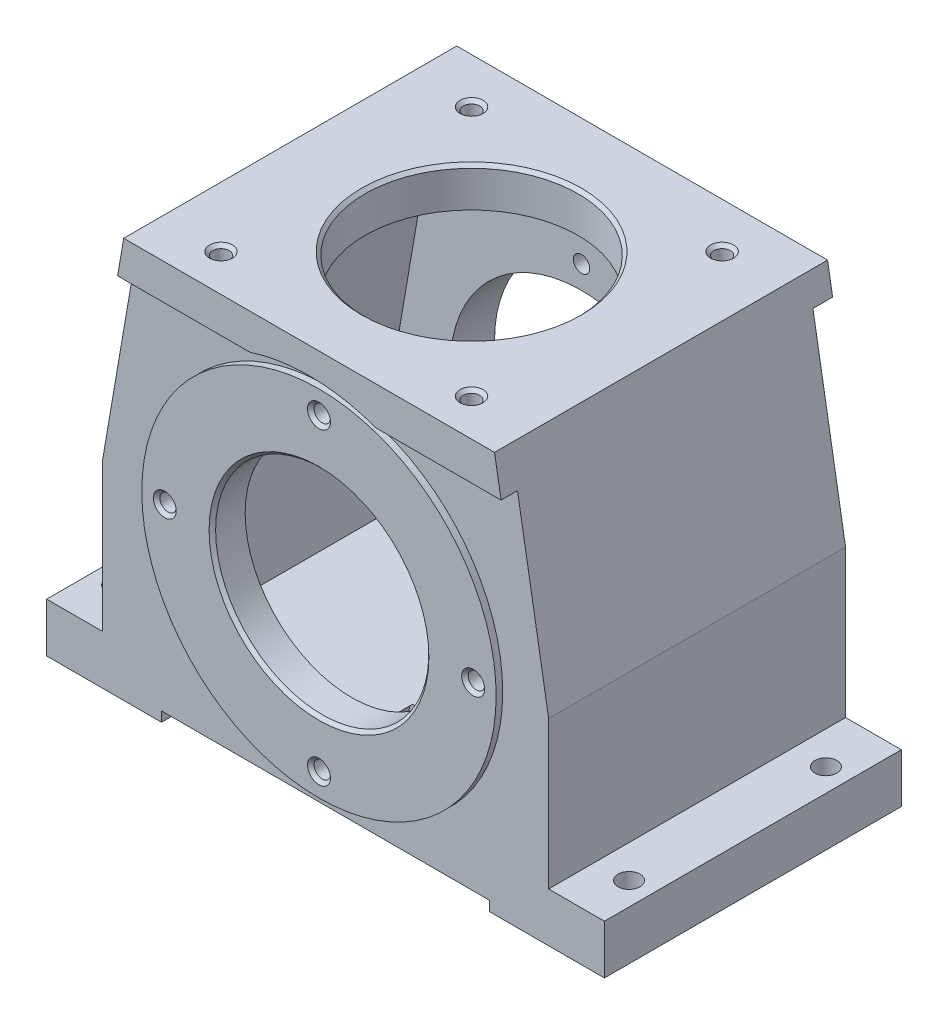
ISO-10303-21;
HEADER;
FILE_DESCRIPTION(('STEP AP214'),'2;1');
FILE_NAME('part.step','',(''),(''),'','','');
FILE_SCHEMA(('AUTOMOTIVE_DESIGN { 1 0 10303 214 1 1 1 1 }'));
ENDSEC;
DATA;
#1=APPLICATION_CONTEXT('core data for automotive mechanical design processes');
#2=APPLICATION_PROTOCOL_DEFINITION('international standard','automotive_design',2000,#1);
#3=PRODUCT_CONTEXT('',#1,'mechanical');
#4=PRODUCT('Part','Part','',(#3));
#5=PRODUCT_RELATED_PRODUCT_CATEGORY('part','',(#4));
#6=PRODUCT_DEFINITION_FORMATION('','',#4);
#7=PRODUCT_DEFINITION_CONTEXT('part definition',#1,'design');
#8=PRODUCT_DEFINITION('design','',#6,#7);
#9=PRODUCT_DEFINITION_SHAPE('','',#8);
#10=(LENGTH_UNIT() NAMED_UNIT(*) SI_UNIT(.MILLI.,.METRE.));
#11=(NAMED_UNIT(*) PLANE_ANGLE_UNIT() SI_UNIT($,.RADIAN.));
#12=(NAMED_UNIT(*) SI_UNIT($,.STERADIAN.) SOLID_ANGLE_UNIT());
#13=UNCERTAINTY_MEASURE_WITH_UNIT(LENGTH_MEASURE(1.E-05),#10,'distance_accuracy_value','');
#14=(GEOMETRIC_REPRESENTATION_CONTEXT(3) GLOBAL_UNCERTAINTY_ASSIGNED_CONTEXT((#13)) GLOBAL_UNIT_ASSIGNED_CONTEXT((#10,
#11,#12)) REPRESENTATION_CONTEXT('',''));
#15=CARTESIAN_POINT('',(0.,0.,0.));
#16=DIRECTION('',(0.,0.,1.));
#17=DIRECTION('',(1.,0.,0.));
#18=AXIS2_PLACEMENT_3D('',#15,#16,#17);
#19=CARTESIAN_POINT('',(56.,133.,44.5));
#20=DIRECTION('',(-0.985622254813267,-0.168963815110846,0.));
#21=DIRECTION('',(0.168963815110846,-0.985622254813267,0.));
#22=AXIS2_PLACEMENT_3D('',#19,#20,#21);
#23=PLANE('',#22);
#24=DIRECTION('',(0.,0.,-1.));
#25=VECTOR('',#24,1.);
#26=CARTESIAN_POINT('',(56.5142857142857,130.,44.5));
#27=LINE('',#26,#25);
#28=CARTESIAN_POINT('',(56.5142857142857,130.,49.5));
#29=VERTEX_POINT('',#28);
#30=CARTESIAN_POINT('',(56.5142857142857,130.,-52.));
#31=VERTEX_POINT('',#30);
#32=EDGE_CURVE('E1013',#29,#31,#27,.T.);
#33=ORIENTED_EDGE('',*,*,#32,.F.);
#34=DIRECTION('',(-0.168963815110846,0.985622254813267,0.));
#35=VECTOR('',#34,1.);
#36=CARTESIAN_POINT('',(58.5044328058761,118.390808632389,49.5));
#37=LINE('',#36,#35);
#38=CARTESIAN_POINT('',(58.5044328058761,118.390808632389,49.5));
#39=VERTEX_POINT('',#38);
#40=EDGE_CURVE('E846',#39,#29,#37,.T.);
#41=ORIENTED_EDGE('',*,*,#40,.F.);
#42=DIRECTION('',(0.,0.,-1.));
#43=VECTOR('',#42,1.);
#44=CARTESIAN_POINT('',(58.5044328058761,118.390808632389,49.5));
#45=LINE('',#44,#43);
#46=CARTESIAN_POINT('',(58.5044328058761,118.390808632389,44.5));
#47=VERTEX_POINT('',#46);
#48=EDGE_CURVE('E844',#39,#47,#45,.T.);
#49=ORIENTED_EDGE('',*,*,#48,.T.);
#50=DIRECTION('',(-0.168963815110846,0.985622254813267,0.));
#51=VECTOR('',#50,1.);
#52=CARTESIAN_POINT('',(56.,133.,44.5));
#53=LINE('',#52,#51);
#54=CARTESIAN_POINT('',(68.,63.,44.5));
#55=VERTEX_POINT('',#54);
#56=EDGE_CURVE('E458',#55,#47,#53,.T.);
#57=ORIENTED_EDGE('',*,*,#56,.F.);
#58=DIRECTION('',(0.,0.,-1.));
#59=VECTOR('',#58,1.);
#60=CARTESIAN_POINT('',(68.,63.,44.5));
#61=LINE('',#60,#59);
#62=CARTESIAN_POINT('',(68.,63.,-46.));
#63=VERTEX_POINT('',#62);
#64=EDGE_CURVE('E463',#55,#63,#61,.T.);
#65=ORIENTED_EDGE('',*,*,#64,.T.);
#66=DIRECTION('',(-0.168963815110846,0.985622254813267,0.));
#67=VECTOR('',#66,1.);
#68=CARTESIAN_POINT('',(56.,133.,-46.));
#69=LINE('',#68,#67);
#70=CARTESIAN_POINT('',(58.0571428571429,121.,-46.));
#71=VERTEX_POINT('',#70);
#72=EDGE_CURVE('E434',#63,#71,#69,.T.);
#73=ORIENTED_EDGE('',*,*,#72,.T.);
#74=DIRECTION('',(0.,0.,1.));
#75=VECTOR('',#74,1.);
#76=CARTESIAN_POINT('',(58.0571428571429,121.,-52.));
#77=LINE('',#76,#75);
#78=CARTESIAN_POINT('',(58.0571428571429,121.,-52.));
#79=VERTEX_POINT('',#78);
#80=EDGE_CURVE('E888',#79,#71,#77,.T.);
#81=ORIENTED_EDGE('',*,*,#80,.F.);
#82=DIRECTION('',(0.168963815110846,-0.985622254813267,0.));
#83=VECTOR('',#82,1.);
#84=CARTESIAN_POINT('',(58.0571428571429,121.,-52.));
#85=LINE('',#84,#83);
#86=EDGE_CURVE('E869',#31,#79,#85,.T.);
#87=ORIENTED_EDGE('',*,*,#86,.F.);
#88=EDGE_LOOP('',(#33,#41,#49,#57,#65,#73,#81,#87));
#89=FACE_BOUND('',#88,.T.);
#90=ADVANCED_FACE('F26',(#89),#23,.F.);
#91=CARTESIAN_POINT('',(-68.,63.,44.5));
#92=DIRECTION('',(0.985622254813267,-0.168963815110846,0.));
#93=DIRECTION('',(0.168963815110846,0.985622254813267,0.));
#94=AXIS2_PLACEMENT_3D('',#91,#92,#93);
#95=PLANE('',#94);
#96=DIRECTION('',(0.,0.,1.));
#97=VECTOR('',#96,1.);
#98=CARTESIAN_POINT('',(-56.5142857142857,130.,44.5));
#99=LINE('',#98,#97);
#100=CARTESIAN_POINT('',(-56.5142857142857,130.,-52.));
#101=VERTEX_POINT('',#100);
#102=CARTESIAN_POINT('',(-56.5142857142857,130.,49.5));
#103=VERTEX_POINT('',#102);
#104=EDGE_CURVE('E487',#101,#103,#99,.T.);
#105=ORIENTED_EDGE('',*,*,#104,.F.);
#106=DIRECTION('',(0.168963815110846,0.985622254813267,0.));
#107=VECTOR('',#106,1.);
#108=CARTESIAN_POINT('',(-56.,133.,-52.));
#109=LINE('',#108,#107);
#110=CARTESIAN_POINT('',(-58.0571428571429,121.,-52.));
#111=VERTEX_POINT('',#110);
#112=EDGE_CURVE('E877',#111,#101,#109,.T.);
#113=ORIENTED_EDGE('',*,*,#112,.F.);
#114=DIRECTION('',(0.,0.,1.));
#115=VECTOR('',#114,1.);
#116=CARTESIAN_POINT('',(-58.0571428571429,121.,-52.));
#117=LINE('',#116,#115);
#118=CARTESIAN_POINT('',(-58.0571428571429,121.,-46.));
#119=VERTEX_POINT('',#118);
#120=EDGE_CURVE('E880',#111,#119,#117,.T.);
#121=ORIENTED_EDGE('',*,*,#120,.T.);
#122=DIRECTION('',(-0.168963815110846,-0.985622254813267,0.));
#123=VECTOR('',#122,1.);
#124=CARTESIAN_POINT('',(-68.,63.,-46.));
#125=LINE('',#124,#123);
#126=CARTESIAN_POINT('',(-68.,63.,-46.));
#127=VERTEX_POINT('',#126);
#128=EDGE_CURVE('E437',#119,#127,#125,.T.);
#129=ORIENTED_EDGE('',*,*,#128,.T.);
#130=DIRECTION('',(0.,0.,-1.));
#131=VECTOR('',#130,1.);
#132=CARTESIAN_POINT('',(-68.,63.,44.5));
#133=LINE('',#132,#131);
#134=CARTESIAN_POINT('',(-68.,63.,44.5));
#135=VERTEX_POINT('',#134);
#136=EDGE_CURVE('E407',#135,#127,#133,.T.);
#137=ORIENTED_EDGE('',*,*,#136,.F.);
#138=DIRECTION('',(-0.168963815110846,-0.985622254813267,0.));
#139=VECTOR('',#138,1.);
#140=CARTESIAN_POINT('',(-68.,63.,44.5));
#141=LINE('',#140,#139);
#142=CARTESIAN_POINT('',(-58.3743608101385,119.149561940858,44.5));
#143=VERTEX_POINT('',#142);
#144=EDGE_CURVE('E460',#143,#135,#141,.T.);
#145=ORIENTED_EDGE('',*,*,#144,.F.);
#146=DIRECTION('',(0.,0.,-1.));
#147=VECTOR('',#146,1.);
#148=CARTESIAN_POINT('',(-58.3743608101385,119.149561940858,49.5));
#149=LINE('',#148,#147);
#150=CARTESIAN_POINT('',(-58.3743608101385,119.149561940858,49.5));
#151=VERTEX_POINT('',#150);
#152=EDGE_CURVE('E859',#151,#143,#149,.T.);
#153=ORIENTED_EDGE('',*,*,#152,.F.);
#154=DIRECTION('',(-0.168963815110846,-0.985622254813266,0.));
#155=VECTOR('',#154,1.);
#156=CARTESIAN_POINT('',(-56.,133.,49.5));
#157=LINE('',#156,#155);
#158=EDGE_CURVE('E1034',#103,#151,#157,.T.);
#159=ORIENTED_EDGE('',*,*,#158,.F.);
#160=EDGE_LOOP('',(#105,#113,#121,#129,#137,#145,#153,#159));
#161=FACE_BOUND('',#160,.T.);
#162=ADVANCED_FACE('F323',(#161),#95,.F.);
#163=CARTESIAN_POINT('',(0.,63.8591001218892,-52.));
#164=DIRECTION('',(0.,0.,-1.));
#165=DIRECTION('',(-1.,0.,0.));
#166=AXIS2_PLACEMENT_3D('',#163,#164,#165);
#167=PLANE('',#166);
#168=ORIENTED_EDGE('',*,*,#112,.T.);
#169=DIRECTION('',(1.,0.,0.));
#170=VECTOR('',#169,1.);
#171=CARTESIAN_POINT('',(0.,130.,-52.));
#172=LINE('',#171,#170);
#173=EDGE_CURVE('E1015',#101,#31,#172,.T.);
#174=ORIENTED_EDGE('',*,*,#173,.T.);
#175=ORIENTED_EDGE('',*,*,#86,.T.);
#176=DIRECTION('',(-1.,0.,0.));
#177=VECTOR('',#176,1.);
#178=CARTESIAN_POINT('',(58.0571428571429,121.,-52.));
#179=LINE('',#178,#177);
#180=CARTESIAN_POINT('',(14.6941335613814,121.,-52.));
#181=VERTEX_POINT('',#180);
#182=EDGE_CURVE('E871',#79,#181,#179,.T.);
#183=ORIENTED_EDGE('',*,*,#182,.T.);
#184=CARTESIAN_POINT('',(0.,63.8591001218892,-52.));
#185=DIRECTION('',(0.,0.,1.));
#186=DIRECTION('',(-1.,0.,0.));
#187=AXIS2_PLACEMENT_3D('',#184,#185,#186);
#188=CIRCLE('',#187,59.);
#189=CARTESIAN_POINT('',(-14.6941335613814,121.,-52.));
#190=VERTEX_POINT('',#189);
#191=EDGE_CURVE('E873',#181,#190,#188,.T.);
#192=ORIENTED_EDGE('',*,*,#191,.T.);
#193=DIRECTION('',(-1.,0.,0.));
#194=VECTOR('',#193,1.);
#195=CARTESIAN_POINT('',(-14.6941335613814,121.,-52.));
#196=LINE('',#195,#194);
#197=EDGE_CURVE('E875',#190,#111,#196,.T.);
#198=ORIENTED_EDGE('',*,*,#197,.T.);
#199=EDGE_LOOP('',(#168,#174,#175,#183,#192,#198));
#200=FACE_BOUND('',#199,.T.);
#201=ADVANCED_FACE('F330',(#200),#167,.T.);
#202=CARTESIAN_POINT('',(0.,63.,49.5));
#203=DIRECTION('',(0.,0.,1.));
#204=DIRECTION('',(1.,0.,0.));
#205=AXIS2_PLACEMENT_3D('',#202,#203,#204);
#206=PLANE('',#205);
#207=ORIENTED_EDGE('',*,*,#40,.T.);
#208=DIRECTION('',(-1.,0.,0.));
#209=VECTOR('',#208,1.);
#210=CARTESIAN_POINT('',(0.,130.,49.5));
#211=LINE('',#210,#209);
#212=EDGE_CURVE('E480',#29,#103,#211,.T.);
#213=ORIENTED_EDGE('',*,*,#212,.T.);
#214=ORIENTED_EDGE('',*,*,#158,.T.);
#215=DIRECTION('',(1.,0.,0.));
#216=VECTOR('',#215,1.);
#217=CARTESIAN_POINT('',(-58.3743608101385,119.149561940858,49.5));
#218=LINE('',#217,#216);
#219=CARTESIAN_POINT('',(-18.1170277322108,119.149561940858,49.5));
#220=VERTEX_POINT('',#219);
#221=EDGE_CURVE('E1036',#151,#220,#218,.T.);
#222=ORIENTED_EDGE('',*,*,#221,.T.);
#223=CARTESIAN_POINT('',(0.,63.,49.5));
#224=DIRECTION('',(0.,0.,-1.));
#225=DIRECTION('',(1.,0.,0.));
#226=AXIS2_PLACEMENT_3D('',#223,#224,#225);
#227=CIRCLE('',#226,59.);
#228=CARTESIAN_POINT('',(20.3189153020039,118.390808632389,49.5));
#229=VERTEX_POINT('',#228);
#230=EDGE_CURVE('E1038',#220,#229,#227,.T.);
#231=ORIENTED_EDGE('',*,*,#230,.T.);
#232=DIRECTION('',(1.,0.,0.));
#233=VECTOR('',#232,1.);
#234=CARTESIAN_POINT('',(20.3189153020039,118.390808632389,49.5));
#235=LINE('',#234,#233);
#236=EDGE_CURVE('E853',#229,#39,#235,.T.);
#237=ORIENTED_EDGE('',*,*,#236,.T.);
#238=EDGE_LOOP('',(#207,#213,#214,#222,#231,#237));
#239=FACE_BOUND('',#238,.T.);
#240=ADVANCED_FACE('F744',(#239),#206,.T.);
#241=CARTESIAN_POINT('',(-68.,18.,44.5));
#242=DIRECTION('',(0.,0.,-1.));
#243=DIRECTION('',(-1.,0.,0.));
#244=AXIS2_PLACEMENT_3D('',#241,#242,#243);
#245=PLANE('',#244);
#246=CARTESIAN_POINT('',(0.,63.,44.5));
#247=DIRECTION('',(0.,0.,-1.));
#248=DIRECTION('',(-1.,0.,0.));
#249=AXIS2_PLACEMENT_3D('',#246,#247,#248);
#250=CIRCLE('',#249,54.);
#251=CARTESIAN_POINT('',(-54.,63.,44.5));
#252=VERTEX_POINT('',#251);
#253=EDGE_CURVE('E392',#252,#252,#250,.F.);
#254=ORIENTED_EDGE('',*,*,#253,.F.);
#255=EDGE_LOOP('',(#254));
#256=FACE_BOUND('',#255,.T.);
#257=DIRECTION('',(-1.,0.,0.));
#258=VECTOR('',#257,1.);
#259=CARTESIAN_POINT('',(-68.,3.,44.5));
#260=LINE('',#259,#258);
#261=CARTESIAN_POINT('',(85.,3.,44.5));
#262=VERTEX_POINT('',#261);
#263=CARTESIAN_POINT('',(50.,3.,44.5));
#264=VERTEX_POINT('',#263);
#265=EDGE_CURVE('E820',#262,#264,#260,.T.);
#266=ORIENTED_EDGE('',*,*,#265,.F.);
#267=DIRECTION('',(0.,1.,0.));
#268=VECTOR('',#267,1.);
#269=CARTESIAN_POINT('',(85.,18.,44.5));
#270=LINE('',#269,#268);
#271=CARTESIAN_POINT('',(85.,18.,44.5));
#272=VERTEX_POINT('',#271);
#273=EDGE_CURVE('E452',#262,#272,#270,.T.);
#274=ORIENTED_EDGE('',*,*,#273,.T.);
#275=DIRECTION('',(-1.,0.,0.));
#276=VECTOR('',#275,1.);
#277=CARTESIAN_POINT('',(68.,18.,44.5));
#278=LINE('',#277,#276);
#279=CARTESIAN_POINT('',(68.,18.,44.5));
#280=VERTEX_POINT('',#279);
#281=EDGE_CURVE('E454',#272,#280,#278,.T.);
#282=ORIENTED_EDGE('',*,*,#281,.T.);
#283=DIRECTION('',(0.,1.,0.));
#284=VECTOR('',#283,1.);
#285=CARTESIAN_POINT('',(68.,63.,44.5));
#286=LINE('',#285,#284);
#287=EDGE_CURVE('E456',#280,#55,#286,.T.);
#288=ORIENTED_EDGE('',*,*,#287,.T.);
#289=ORIENTED_EDGE('',*,*,#56,.T.);
#290=DIRECTION('',(1.,0.,0.));
#291=VECTOR('',#290,1.);
#292=CARTESIAN_POINT('',(20.3189153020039,118.390808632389,44.5));
#293=LINE('',#292,#291);
#294=CARTESIAN_POINT('',(20.3189153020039,118.390808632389,44.5));
#295=VERTEX_POINT('',#294);
#296=EDGE_CURVE('E1032',#295,#47,#293,.T.);
#297=ORIENTED_EDGE('',*,*,#296,.F.);
#298=CARTESIAN_POINT('',(0.,63.,44.5));
#299=DIRECTION('',(0.,0.,-1.));
#300=DIRECTION('',(1.,0.,0.));
#301=AXIS2_PLACEMENT_3D('',#298,#299,#300);
#302=CIRCLE('',#301,59.);
#303=CARTESIAN_POINT('',(-18.1170277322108,119.149561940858,44.5));
#304=VERTEX_POINT('',#303);
#305=EDGE_CURVE('E1029',#304,#295,#302,.T.);
#306=ORIENTED_EDGE('',*,*,#305,.F.);
#307=DIRECTION('',(1.,0.,0.));
#308=VECTOR('',#307,1.);
#309=CARTESIAN_POINT('',(-58.3743608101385,119.149561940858,44.5));
#310=LINE('',#309,#308);
#311=EDGE_CURVE('E1026',#143,#304,#310,.T.);
#312=ORIENTED_EDGE('',*,*,#311,.F.);
#313=ORIENTED_EDGE('',*,*,#144,.T.);
#314=DIRECTION('',(0.,-1.,0.));
#315=VECTOR('',#314,1.);
#316=CARTESIAN_POINT('',(-68.,18.,44.5));
#317=LINE('',#316,#315);
#318=CARTESIAN_POINT('',(-68.,18.,44.5));
#319=VERTEX_POINT('',#318);
#320=EDGE_CURVE('E439',#135,#319,#317,.T.);
#321=ORIENTED_EDGE('',*,*,#320,.T.);
#322=DIRECTION('',(-1.,0.,0.));
#323=VECTOR('',#322,1.);
#324=CARTESIAN_POINT('',(-85.,18.,44.5));
#325=LINE('',#324,#323);
#326=CARTESIAN_POINT('',(-85.,18.,44.5));
#327=VERTEX_POINT('',#326);
#328=EDGE_CURVE('E388',#319,#327,#325,.T.);
#329=ORIENTED_EDGE('',*,*,#328,.T.);
#330=DIRECTION('',(0.,-1.,0.));
#331=VECTOR('',#330,1.);
#332=CARTESIAN_POINT('',(-85.,0.,44.5));
#333=LINE('',#332,#331);
#334=CARTESIAN_POINT('',(-85.,3.,44.5));
#335=VERTEX_POINT('',#334);
#336=EDGE_CURVE('E442',#327,#335,#333,.T.);
#337=ORIENTED_EDGE('',*,*,#336,.T.);
#338=CARTESIAN_POINT('',(-50.,3.,44.5));
#339=VERTEX_POINT('',#338);
#340=EDGE_CURVE('E829',#339,#335,#260,.T.);
#341=ORIENTED_EDGE('',*,*,#340,.F.);
#342=DIRECTION('',(0.,1.,0.));
#343=VECTOR('',#342,1.);
#344=CARTESIAN_POINT('',(-50.,6.00000000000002,44.5));
#345=LINE('',#344,#343);
#346=CARTESIAN_POINT('',(-50.,6.00000000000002,44.5));
#347=VERTEX_POINT('',#346);
#348=EDGE_CURVE('E445',#339,#347,#345,.T.);
#349=ORIENTED_EDGE('',*,*,#348,.T.);
#350=DIRECTION('',(1.,0.,0.));
#351=VECTOR('',#350,1.);
#352=CARTESIAN_POINT('',(50.,6.00000000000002,44.5));
#353=LINE('',#352,#351);
#354=CARTESIAN_POINT('',(50.,6.00000000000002,44.5));
#355=VERTEX_POINT('',#354);
#356=EDGE_CURVE('E447',#347,#355,#353,.T.);
#357=ORIENTED_EDGE('',*,*,#356,.T.);
#358=DIRECTION('',(0.,-1.,0.));
#359=VECTOR('',#358,1.);
#360=CARTESIAN_POINT('',(50.,6.00000000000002,44.5));
#361=LINE('',#360,#359);
#362=EDGE_CURVE('E449',#355,#264,#361,.T.);
#363=ORIENTED_EDGE('',*,*,#362,.T.);
#364=EDGE_LOOP('',(#266,#274,#282,#288,#289,#297,#306,#312,#313,#321,#329,#337,#341,#349,#357,#363));
#365=FACE_BOUND('',#364,.T.);
#366=ADVANCED_FACE('F747',(#256,#365),#245,.F.);
#367=CARTESIAN_POINT('',(-68.,18.,-46.));
#368=DIRECTION('',(0.,0.,-1.));
#369=DIRECTION('',(-1.,0.,0.));
#370=AXIS2_PLACEMENT_3D('',#367,#368,#369);
#371=PLANE('',#370);
#372=CARTESIAN_POINT('',(0.,63.,-46.));
#373=DIRECTION('',(0.,0.,-1.));
#374=DIRECTION('',(-1.,0.,0.));
#375=AXIS2_PLACEMENT_3D('',#372,#373,#374);
#376=CIRCLE('',#375,54.);
#377=CARTESIAN_POINT('',(-54.,63.,-46.));
#378=VERTEX_POINT('',#377);
#379=EDGE_CURVE('E890',#378,#378,#376,.T.);
#380=ORIENTED_EDGE('',*,*,#379,.F.);
#381=EDGE_LOOP('',(#380));
#382=FACE_BOUND('',#381,.T.);
#383=DIRECTION('',(0.,1.,0.));
#384=VECTOR('',#383,1.);
#385=CARTESIAN_POINT('',(85.,18.,-46.));
#386=LINE('',#385,#384);
#387=CARTESIAN_POINT('',(85.,3.,-46.));
#388=VERTEX_POINT('',#387);
#389=CARTESIAN_POINT('',(85.,18.,-46.));
#390=VERTEX_POINT('',#389);
#391=EDGE_CURVE('E426',#388,#390,#386,.T.);
#392=ORIENTED_EDGE('',*,*,#391,.F.);
#393=DIRECTION('',(-1.,0.,0.));
#394=VECTOR('',#393,1.);
#395=CARTESIAN_POINT('',(-68.,3.,-46.));
#396=LINE('',#395,#394);
#397=CARTESIAN_POINT('',(50.,3.,-46.));
#398=VERTEX_POINT('',#397);
#399=EDGE_CURVE('E827',#388,#398,#396,.T.);
#400=ORIENTED_EDGE('',*,*,#399,.T.);
#401=DIRECTION('',(0.,-1.,0.));
#402=VECTOR('',#401,1.);
#403=CARTESIAN_POINT('',(50.,6.00000000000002,-46.));
#404=LINE('',#403,#402);
#405=CARTESIAN_POINT('',(50.,6.00000000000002,-46.));
#406=VERTEX_POINT('',#405);
#407=EDGE_CURVE('E423',#406,#398,#404,.T.);
#408=ORIENTED_EDGE('',*,*,#407,.F.);
#409=DIRECTION('',(1.,0.,0.));
#410=VECTOR('',#409,1.);
#411=CARTESIAN_POINT('',(50.,6.00000000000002,-46.));
#412=LINE('',#411,#410);
#413=CARTESIAN_POINT('',(-50.,6.00000000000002,-46.));
#414=VERTEX_POINT('',#413);
#415=EDGE_CURVE('E420',#414,#406,#412,.T.);
#416=ORIENTED_EDGE('',*,*,#415,.F.);
#417=DIRECTION('',(0.,1.,0.));
#418=VECTOR('',#417,1.);
#419=CARTESIAN_POINT('',(-50.,6.00000000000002,-46.));
#420=LINE('',#419,#418);
#421=CARTESIAN_POINT('',(-50.,3.,-46.));
#422=VERTEX_POINT('',#421);
#423=EDGE_CURVE('E418',#422,#414,#420,.T.);
#424=ORIENTED_EDGE('',*,*,#423,.F.);
#425=CARTESIAN_POINT('',(-85.,3.,-46.));
#426=VERTEX_POINT('',#425);
#427=EDGE_CURVE('E1019',#422,#426,#396,.T.);
#428=ORIENTED_EDGE('',*,*,#427,.T.);
#429=DIRECTION('',(0.,-1.,0.));
#430=VECTOR('',#429,1.);
#431=CARTESIAN_POINT('',(-85.,0.,-46.));
#432=LINE('',#431,#430);
#433=CARTESIAN_POINT('',(-85.,18.,-46.));
#434=VERTEX_POINT('',#433);
#435=EDGE_CURVE('E403',#434,#426,#432,.T.);
#436=ORIENTED_EDGE('',*,*,#435,.F.);
#437=DIRECTION('',(-1.,0.,0.));
#438=VECTOR('',#437,1.);
#439=CARTESIAN_POINT('',(-85.,18.,-46.));
#440=LINE('',#439,#438);
#441=CARTESIAN_POINT('',(-68.,18.,-46.));
#442=VERTEX_POINT('',#441);
#443=EDGE_CURVE('E387',#442,#434,#440,.T.);
#444=ORIENTED_EDGE('',*,*,#443,.F.);
#445=DIRECTION('',(0.,-1.,0.));
#446=VECTOR('',#445,1.);
#447=CARTESIAN_POINT('',(-68.,18.,-46.));
#448=LINE('',#447,#446);
#449=EDGE_CURVE('E400',#127,#442,#448,.T.);
#450=ORIENTED_EDGE('',*,*,#449,.F.);
#451=ORIENTED_EDGE('',*,*,#128,.F.);
#452=DIRECTION('',(-1.,0.,0.));
#453=VECTOR('',#452,1.);
#454=CARTESIAN_POINT('',(-14.6941335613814,121.,-46.));
#455=LINE('',#454,#453);
#456=CARTESIAN_POINT('',(-14.6941335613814,121.,-46.));
#457=VERTEX_POINT('',#456);
#458=EDGE_CURVE('E866',#457,#119,#455,.T.);
#459=ORIENTED_EDGE('',*,*,#458,.F.);
#460=CARTESIAN_POINT('',(0.,63.8591001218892,-46.));
#461=DIRECTION('',(0.,0.,1.));
#462=DIRECTION('',(-1.,0.,0.));
#463=AXIS2_PLACEMENT_3D('',#460,#461,#462);
#464=CIRCLE('',#463,59.);
#465=CARTESIAN_POINT('',(14.6941335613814,121.,-46.));
#466=VERTEX_POINT('',#465);
#467=EDGE_CURVE('E864',#466,#457,#464,.T.);
#468=ORIENTED_EDGE('',*,*,#467,.F.);
#469=DIRECTION('',(-1.,0.,0.));
#470=VECTOR('',#469,1.);
#471=CARTESIAN_POINT('',(58.0571428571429,121.,-46.));
#472=LINE('',#471,#470);
#473=EDGE_CURVE('E862',#71,#466,#472,.T.);
#474=ORIENTED_EDGE('',*,*,#473,.F.);
#475=ORIENTED_EDGE('',*,*,#72,.F.);
#476=DIRECTION('',(0.,1.,0.));
#477=VECTOR('',#476,1.);
#478=CARTESIAN_POINT('',(68.,63.,-46.));
#479=LINE('',#478,#477);
#480=CARTESIAN_POINT('',(68.,18.,-46.));
#481=VERTEX_POINT('',#480);
#482=EDGE_CURVE('E431',#481,#63,#479,.T.);
#483=ORIENTED_EDGE('',*,*,#482,.F.);
#484=DIRECTION('',(-1.,0.,0.));
#485=VECTOR('',#484,1.);
#486=CARTESIAN_POINT('',(68.,18.,-46.));
#487=LINE('',#486,#485);
#488=EDGE_CURVE('E428',#390,#481,#487,.T.);
#489=ORIENTED_EDGE('',*,*,#488,.F.);
#490=EDGE_LOOP('',(#392,#400,#408,#416,#424,#428,#436,#444,#450,#451,#459,#468,#474,#475,#483,#489));
#491=FACE_BOUND('',#490,.T.);
#492=ADVANCED_FACE('F364',(#382,#491),#371,.T.);
#493=CARTESIAN_POINT('',(-85.,0.,44.5));
#494=DIRECTION('',(1.,0.,0.));
#495=DIRECTION('',(0.,0.,-1.));
#496=AXIS2_PLACEMENT_3D('',#493,#494,#495);
#497=PLANE('',#496);
#498=DIRECTION('',(0.,0.,-1.));
#499=VECTOR('',#498,1.);
#500=CARTESIAN_POINT('',(-85.,3.,44.5));
#501=LINE('',#500,#499);
#502=EDGE_CURVE('E1024',#335,#426,#501,.T.);
#503=ORIENTED_EDGE('',*,*,#502,.F.);
#504=ORIENTED_EDGE('',*,*,#336,.F.);
#505=DIRECTION('',(0.,0.,-1.));
#506=VECTOR('',#505,1.);
#507=CARTESIAN_POINT('',(-85.,18.,44.5));
#508=LINE('',#507,#506);
#509=EDGE_CURVE('E393',#327,#434,#508,.T.);
#510=ORIENTED_EDGE('',*,*,#509,.T.);
#511=ORIENTED_EDGE('',*,*,#435,.T.);
#512=EDGE_LOOP('',(#503,#504,#510,#511));
#513=FACE_BOUND('',#512,.T.);
#514=ADVANCED_FACE('F361',(#513),#497,.F.);
#515=CARTESIAN_POINT('',(-50.,6.00000000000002,44.5));
#516=DIRECTION('',(-1.,0.,0.));
#517=DIRECTION('',(0.,0.,1.));
#518=AXIS2_PLACEMENT_3D('',#515,#516,#517);
#519=PLANE('',#518);
#520=DIRECTION('',(0.,0.,1.));
#521=VECTOR('',#520,1.);
#522=CARTESIAN_POINT('',(-50.,3.,44.5));
#523=LINE('',#522,#521);
#524=EDGE_CURVE('E1022',#422,#339,#523,.T.);
#525=ORIENTED_EDGE('',*,*,#524,.F.);
#526=ORIENTED_EDGE('',*,*,#423,.T.);
#527=DIRECTION('',(0.,0.,-1.));
#528=VECTOR('',#527,1.);
#529=CARTESIAN_POINT('',(-50.,6.00000000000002,44.5));
#530=LINE('',#529,#528);
#531=EDGE_CURVE('E472',#347,#414,#530,.T.);
#532=ORIENTED_EDGE('',*,*,#531,.F.);
#533=ORIENTED_EDGE('',*,*,#348,.F.);
#534=EDGE_LOOP('',(#525,#526,#532,#533));
#535=FACE_BOUND('',#534,.T.);
#536=ADVANCED_FACE('F353',(#535),#519,.F.);
#537=CARTESIAN_POINT('',(50.,6.00000000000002,44.5));
#538=DIRECTION('',(1.,0.,0.));
#539=DIRECTION('',(0.,0.,-1.));
#540=AXIS2_PLACEMENT_3D('',#537,#538,#539);
#541=PLANE('',#540);
#542=DIRECTION('',(0.,0.,-1.));
#543=VECTOR('',#542,1.);
#544=CARTESIAN_POINT('',(50.,3.,44.5));
#545=LINE('',#544,#543);
#546=EDGE_CURVE('E826',#264,#398,#545,.T.);
#547=ORIENTED_EDGE('',*,*,#546,.F.);
#548=ORIENTED_EDGE('',*,*,#362,.F.);
#549=DIRECTION('',(0.,0.,-1.));
#550=VECTOR('',#549,1.);
#551=CARTESIAN_POINT('',(50.,6.00000000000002,44.5));
#552=LINE('',#551,#550);
#553=EDGE_CURVE('E470',#355,#406,#552,.T.);
#554=ORIENTED_EDGE('',*,*,#553,.T.);
#555=ORIENTED_EDGE('',*,*,#407,.T.);
#556=EDGE_LOOP('',(#547,#548,#554,#555));
#557=FACE_BOUND('',#556,.T.);
#558=ADVANCED_FACE('F349',(#557),#541,.F.);
#559=CARTESIAN_POINT('',(85.,18.,44.5));
#560=DIRECTION('',(-1.,0.,0.));
#561=DIRECTION('',(0.,0.,1.));
#562=AXIS2_PLACEMENT_3D('',#559,#560,#561);
#563=PLANE('',#562);
#564=DIRECTION('',(0.,0.,1.));
#565=VECTOR('',#564,1.);
#566=CARTESIAN_POINT('',(85.,3.,44.5));
#567=LINE('',#566,#565);
#568=EDGE_CURVE('E478',#388,#262,#567,.T.);
#569=ORIENTED_EDGE('',*,*,#568,.F.);
#570=ORIENTED_EDGE('',*,*,#391,.T.);
#571=DIRECTION('',(0.,0.,-1.));
#572=VECTOR('',#571,1.);
#573=CARTESIAN_POINT('',(85.,18.,44.5));
#574=LINE('',#573,#572);
#575=EDGE_CURVE('E467',#272,#390,#574,.T.);
#576=ORIENTED_EDGE('',*,*,#575,.F.);
#577=ORIENTED_EDGE('',*,*,#273,.F.);
#578=EDGE_LOOP('',(#569,#570,#576,#577));
#579=FACE_BOUND('',#578,.T.);
#580=ADVANCED_FACE('F346',(#579),#563,.F.);
#581=CARTESIAN_POINT('',(-46.3963788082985,118.,-33.5));
#582=DIRECTION('',(0.,1.,0.));
#583=DIRECTION('',(0.,0.,1.));
#584=AXIS2_PLACEMENT_3D('',#581,#582,#583);
#585=PLANE('',#584);
#586=CARTESIAN_POINT('',(0.,118.,0.));
#587=DIRECTION('',(0.,1.,0.));
#588=DIRECTION('',(0.,0.,1.));
#589=AXIS2_PLACEMENT_3D('',#586,#587,#588);
#590=CIRCLE('',#589,32.5);
#591=CARTESIAN_POINT('',(0.,118.,32.5));
#592=VERTEX_POINT('',#591);
#593=EDGE_CURVE('E1001',#592,#592,#590,.T.);
#594=ORIENTED_EDGE('',*,*,#593,.T.);
#595=EDGE_LOOP('',(#594));
#596=FACE_BOUND('',#595,.T.);
#597=DIRECTION('',(-1.,0.,0.));
#598=VECTOR('',#597,1.);
#599=CARTESIAN_POINT('',(-46.3963788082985,118.,36.5));
#600=LINE('',#599,#598);
#601=CARTESIAN_POINT('',(46.3963788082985,118.,36.5));
#602=VERTEX_POINT('',#601);
#603=CARTESIAN_POINT('',(40.031719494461,118.,36.5));
#604=VERTEX_POINT('',#603);
#605=EDGE_CURVE('E910',#602,#604,#600,.T.);
#606=ORIENTED_EDGE('',*,*,#605,.T.);
#607=CARTESIAN_POINT('',(38.1837661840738,118.,38.1837661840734));
#608=DIRECTION('',(0.,1.,0.));
#609=DIRECTION('',(0.,0.,1.));
#610=AXIS2_PLACEMENT_3D('',#607,#608,#609);
#611=CIRCLE('',#610,2.5);
#612=CARTESIAN_POINT('',(36.3358128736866,118.,36.5));
#613=VERTEX_POINT('',#612);
#614=EDGE_CURVE('E955',#604,#613,#611,.T.);
#615=ORIENTED_EDGE('',*,*,#614,.T.);
#616=CARTESIAN_POINT('',(-36.3358128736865,118.,36.5));
#617=VERTEX_POINT('',#616);
#618=EDGE_CURVE('E914',#613,#617,#600,.T.);
#619=ORIENTED_EDGE('',*,*,#618,.T.);
#620=CARTESIAN_POINT('',(-38.1837661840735,118.,38.1837661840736));
#621=DIRECTION('',(0.,1.,0.));
#622=DIRECTION('',(0.,0.,1.));
#623=AXIS2_PLACEMENT_3D('',#620,#621,#622);
#624=CIRCLE('',#623,2.5);
#625=CARTESIAN_POINT('',(-40.0317194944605,118.,36.5));
#626=VERTEX_POINT('',#625);
#627=EDGE_CURVE('E951',#617,#626,#624,.T.);
#628=ORIENTED_EDGE('',*,*,#627,.T.);
#629=CARTESIAN_POINT('',(-46.3963788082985,118.,36.5));
#630=VERTEX_POINT('',#629);
#631=EDGE_CURVE('E909',#626,#630,#600,.T.);
#632=ORIENTED_EDGE('',*,*,#631,.T.);
#633=DIRECTION('',(0.,0.,1.));
#634=VECTOR('',#633,1.);
#635=CARTESIAN_POINT('',(-46.3963788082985,118.,-33.5));
#636=LINE('',#635,#634);
#637=CARTESIAN_POINT('',(-46.3963788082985,118.,-33.5));
#638=VERTEX_POINT('',#637);
#639=EDGE_CURVE('E408',#638,#630,#636,.T.);
#640=ORIENTED_EDGE('',*,*,#639,.F.);
#641=DIRECTION('',(-1.,0.,0.));
#642=VECTOR('',#641,1.);
#643=CARTESIAN_POINT('',(-46.3963788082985,118.,-33.5));
#644=LINE('',#643,#642);
#645=CARTESIAN_POINT('',(46.3963788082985,118.,-33.5));
#646=VERTEX_POINT('',#645);
#647=EDGE_CURVE('E929',#646,#638,#644,.T.);
#648=ORIENTED_EDGE('',*,*,#647,.F.);
#649=DIRECTION('',(0.,0.,1.));
#650=VECTOR('',#649,1.);
#651=CARTESIAN_POINT('',(46.3963788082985,118.,-33.5));
#652=LINE('',#651,#650);
#653=EDGE_CURVE('E411',#646,#602,#652,.T.);
#654=ORIENTED_EDGE('',*,*,#653,.T.);
#655=EDGE_LOOP('',(#606,#615,#619,#628,#632,#640,#648,#654));
#656=FACE_BOUND('',#655,.T.);
#657=ADVANCED_FACE('F348',(#596,#656),#585,.F.);
#658=CARTESIAN_POINT('',(-56.,61.9788763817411,-33.5));
#659=DIRECTION('',(-0.985622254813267,0.168963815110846,0.));
#660=DIRECTION('',(-0.168963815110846,-0.985622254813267,0.));
#661=AXIS2_PLACEMENT_3D('',#658,#659,#660);
#662=PLANE('',#661);
#663=DIRECTION('',(0.,0.,1.));
#664=VECTOR('',#663,1.);
#665=CARTESIAN_POINT('',(-56.,61.9788763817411,-33.5));
#666=LINE('',#665,#664);
#667=CARTESIAN_POINT('',(-56.,61.9788763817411,-33.5));
#668=VERTEX_POINT('',#667);
#669=CARTESIAN_POINT('',(-56.,61.9788763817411,36.5));
#670=VERTEX_POINT('',#669);
#671=EDGE_CURVE('E414',#668,#670,#666,.T.);
#672=ORIENTED_EDGE('',*,*,#671,.F.);
#673=DIRECTION('',(-0.168963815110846,-0.985622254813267,0.));
#674=VECTOR('',#673,1.);
#675=CARTESIAN_POINT('',(-56.,61.9788763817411,-33.5));
#676=LINE('',#675,#674);
#677=EDGE_CURVE('E913',#638,#668,#676,.T.);
#678=ORIENTED_EDGE('',*,*,#677,.F.);
#679=ORIENTED_EDGE('',*,*,#639,.T.);
#680=DIRECTION('',(-0.168963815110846,-0.985622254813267,0.));
#681=VECTOR('',#680,1.);
#682=CARTESIAN_POINT('',(-56.,61.9788763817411,36.5));
#683=LINE('',#682,#681);
#684=EDGE_CURVE('E893',#630,#670,#683,.T.);
#685=ORIENTED_EDGE('',*,*,#684,.T.);
#686=EDGE_LOOP('',(#672,#678,#679,#685));
#687=FACE_BOUND('',#686,.T.);
#688=ADVANCED_FACE('F793',(#687),#662,.F.);
#689=CARTESIAN_POINT('',(46.3963788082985,118.,-33.5));
#690=DIRECTION('',(0.985622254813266,0.168963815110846,0.));
#691=DIRECTION('',(-0.168963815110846,0.985622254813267,0.));
#692=AXIS2_PLACEMENT_3D('',#689,#690,#691);
#693=PLANE('',#692);
#694=ORIENTED_EDGE('',*,*,#653,.F.);
#695=DIRECTION('',(-0.168963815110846,0.985622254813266,0.));
#696=VECTOR('',#695,1.);
#697=CARTESIAN_POINT('',(46.3963788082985,118.,-33.5));
#698=LINE('',#697,#696);
#699=CARTESIAN_POINT('',(56.,61.9788763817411,-33.5));
#700=VERTEX_POINT('',#699);
#701=EDGE_CURVE('E926',#700,#646,#698,.T.);
#702=ORIENTED_EDGE('',*,*,#701,.F.);
#703=DIRECTION('',(0.,0.,1.));
#704=VECTOR('',#703,1.);
#705=CARTESIAN_POINT('',(56.,61.9788763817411,-33.5));
#706=LINE('',#705,#704);
#707=CARTESIAN_POINT('',(56.,61.9788763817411,36.5));
#708=VERTEX_POINT('',#707);
#709=EDGE_CURVE('E933',#700,#708,#706,.T.);
#710=ORIENTED_EDGE('',*,*,#709,.T.);
#711=DIRECTION('',(-0.168963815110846,0.985622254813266,0.));
#712=VECTOR('',#711,1.);
#713=CARTESIAN_POINT('',(46.3963788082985,118.,36.5));
#714=LINE('',#713,#712);
#715=EDGE_CURVE('E906',#708,#602,#714,.T.);
#716=ORIENTED_EDGE('',*,*,#715,.T.);
#717=EDGE_LOOP('',(#694,#702,#710,#716));
#718=FACE_BOUND('',#717,.T.);
#719=ADVANCED_FACE('F795',(#718),#693,.F.);
#720=CARTESIAN_POINT('',(56.,61.9788763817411,-33.5));
#721=DIRECTION('',(1.,0.,0.));
#722=DIRECTION('',(0.,1.,0.));
#723=AXIS2_PLACEMENT_3D('',#720,#721,#722);
#724=PLANE('',#723);
#725=ORIENTED_EDGE('',*,*,#709,.F.);
#726=DIRECTION('',(0.,1.,0.));
#727=VECTOR('',#726,1.);
#728=CARTESIAN_POINT('',(56.,61.9788763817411,-33.5));
#729=LINE('',#728,#727);
#730=CARTESIAN_POINT('',(56.,17.998876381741,-33.5));
#731=VERTEX_POINT('',#730);
#732=EDGE_CURVE('E923',#731,#700,#729,.T.);
#733=ORIENTED_EDGE('',*,*,#732,.F.);
#734=DIRECTION('',(0.,0.,1.));
#735=VECTOR('',#734,1.);
#736=CARTESIAN_POINT('',(56.,17.998876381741,-33.5));
#737=LINE('',#736,#735);
#738=CARTESIAN_POINT('',(56.,17.998876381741,36.5));
#739=VERTEX_POINT('',#738);
#740=EDGE_CURVE('E935',#731,#739,#737,.T.);
#741=ORIENTED_EDGE('',*,*,#740,.T.);
#742=DIRECTION('',(0.,1.,0.));
#743=VECTOR('',#742,1.);
#744=CARTESIAN_POINT('',(56.,61.9788763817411,36.5));
#745=LINE('',#744,#743);
#746=EDGE_CURVE('E903',#739,#708,#745,.T.);
#747=ORIENTED_EDGE('',*,*,#746,.T.);
#748=EDGE_LOOP('',(#725,#733,#741,#747));
#749=FACE_BOUND('',#748,.T.);
#750=ADVANCED_FACE('F798',(#749),#724,.F.);
#751=CARTESIAN_POINT('',(56.,17.998876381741,-33.5));
#752=DIRECTION('',(0.,-1.,0.));
#753=DIRECTION('',(1.,0.,0.));
#754=AXIS2_PLACEMENT_3D('',#751,#752,#753);
#755=PLANE('',#754);
#756=DIRECTION('',(1.,0.,0.));
#757=VECTOR('',#756,1.);
#758=CARTESIAN_POINT('',(56.,17.998876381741,-28.));
#759=LINE('',#758,#757);
#760=CARTESIAN_POINT('',(-1.50149698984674,17.998876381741,-28.));
#761=VERTEX_POINT('',#760);
#762=CARTESIAN_POINT('',(1.50149698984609,17.998876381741,-28.));
#763=VERTEX_POINT('',#762);
#764=EDGE_CURVE('E271',#761,#763,#759,.T.);
#765=ORIENTED_EDGE('',*,*,#764,.F.);
#766=DIRECTION('',(0.,0.,-1.));
#767=VECTOR('',#766,1.);
#768=CARTESIAN_POINT('',(-1.50149698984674,17.998876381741,-28.));
#769=LINE('',#768,#767);
#770=CARTESIAN_POINT('',(-1.50149698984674,17.998876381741,-33.5));
#771=VERTEX_POINT('',#770);
#772=EDGE_CURVE('E258',#761,#771,#769,.T.);
#773=ORIENTED_EDGE('',*,*,#772,.T.);
#774=DIRECTION('',(1.,0.,0.));
#775=VECTOR('',#774,1.);
#776=CARTESIAN_POINT('',(56.,17.998876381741,-33.5));
#777=LINE('',#776,#775);
#778=CARTESIAN_POINT('',(-56.,17.998876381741,-33.5));
#779=VERTEX_POINT('',#778);
#780=EDGE_CURVE('E921',#779,#771,#777,.T.);
#781=ORIENTED_EDGE('',*,*,#780,.F.);
#782=DIRECTION('',(0.,0.,1.));
#783=VECTOR('',#782,1.);
#784=CARTESIAN_POINT('',(-56.,17.998876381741,-33.5));
#785=LINE('',#784,#783);
#786=CARTESIAN_POINT('',(-56.,17.998876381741,36.5));
#787=VERTEX_POINT('',#786);
#788=EDGE_CURVE('E937',#779,#787,#785,.T.);
#789=ORIENTED_EDGE('',*,*,#788,.T.);
#790=DIRECTION('',(1.,0.,0.));
#791=VECTOR('',#790,1.);
#792=CARTESIAN_POINT('',(56.,17.998876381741,36.5));
#793=LINE('',#792,#791);
#794=CARTESIAN_POINT('',(-1.50149698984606,17.998876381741,36.5));
#795=VERTEX_POINT('',#794);
#796=EDGE_CURVE('E900',#787,#795,#793,.T.);
#797=ORIENTED_EDGE('',*,*,#796,.T.);
#798=DIRECTION('',(0.,0.,1.));
#799=VECTOR('',#798,1.);
#800=CARTESIAN_POINT('',(-1.50149698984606,17.998876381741,16.5));
#801=LINE('',#800,#799);
#802=CARTESIAN_POINT('',(-1.50149698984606,17.998876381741,16.5));
#803=VERTEX_POINT('',#802);
#804=EDGE_CURVE('E981',#795,#803,#801,.F.);
#805=ORIENTED_EDGE('',*,*,#804,.T.);
#806=DIRECTION('',(-1.,0.,0.));
#807=VECTOR('',#806,1.);
#808=CARTESIAN_POINT('',(56.,17.998876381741,16.5));
#809=LINE('',#808,#807);
#810=CARTESIAN_POINT('',(1.50149698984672,17.998876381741,16.5));
#811=VERTEX_POINT('',#810);
#812=EDGE_CURVE('E530',#811,#803,#809,.T.);
#813=ORIENTED_EDGE('',*,*,#812,.F.);
#814=DIRECTION('',(0.,0.,1.));
#815=VECTOR('',#814,1.);
#816=CARTESIAN_POINT('',(1.50149698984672,17.998876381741,16.5));
#817=LINE('',#816,#815);
#818=CARTESIAN_POINT('',(1.50149698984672,17.998876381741,36.5));
#819=VERTEX_POINT('',#818);
#820=EDGE_CURVE('E984',#811,#819,#817,.T.);
#821=ORIENTED_EDGE('',*,*,#820,.T.);
#822=EDGE_CURVE('E899',#819,#739,#793,.T.);
#823=ORIENTED_EDGE('',*,*,#822,.T.);
#824=ORIENTED_EDGE('',*,*,#740,.F.);
#825=CARTESIAN_POINT('',(1.50149698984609,17.998876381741,-33.5));
#826=VERTEX_POINT('',#825);
#827=EDGE_CURVE('E920',#826,#731,#777,.T.);
#828=ORIENTED_EDGE('',*,*,#827,.F.);
#829=DIRECTION('',(0.,0.,-1.));
#830=VECTOR('',#829,1.);
#831=CARTESIAN_POINT('',(1.50149698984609,17.998876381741,-28.));
#832=LINE('',#831,#830);
#833=EDGE_CURVE('E41',#826,#763,#832,.F.);
#834=ORIENTED_EDGE('',*,*,#833,.T.);
#835=EDGE_LOOP('',(#765,#773,#781,#789,#797,#805,#813,#821,#823,#824,#828,#834));
#836=FACE_BOUND('',#835,.T.);
#837=ADVANCED_FACE('F274',(#836),#755,.F.);
#838=CARTESIAN_POINT('',(-56.,17.998876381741,-33.5));
#839=DIRECTION('',(-1.,0.,0.));
#840=DIRECTION('',(0.,0.,1.));
#841=AXIS2_PLACEMENT_3D('',#838,#839,#840);
#842=PLANE('',#841);
#843=ORIENTED_EDGE('',*,*,#788,.F.);
#844=DIRECTION('',(0.,-1.,0.));
#845=VECTOR('',#844,1.);
#846=CARTESIAN_POINT('',(-56.,17.998876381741,-33.5));
#847=LINE('',#846,#845);
#848=EDGE_CURVE('E917',#668,#779,#847,.T.);
#849=ORIENTED_EDGE('',*,*,#848,.F.);
#850=ORIENTED_EDGE('',*,*,#671,.T.);
#851=DIRECTION('',(0.,-1.,0.));
#852=VECTOR('',#851,1.);
#853=CARTESIAN_POINT('',(-56.,17.998876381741,36.5));
#854=LINE('',#853,#852);
#855=EDGE_CURVE('E896',#670,#787,#854,.T.);
#856=ORIENTED_EDGE('',*,*,#855,.T.);
#857=EDGE_LOOP('',(#843,#849,#850,#856));
#858=FACE_BOUND('',#857,.T.);
#859=ADVANCED_FACE('F789',(#858),#842,.F.);
#860=CARTESIAN_POINT('',(-46.3963788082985,118.,-33.5));
#861=DIRECTION('',(0.,0.,-1.));
#862=DIRECTION('',(-1.,0.,0.));
#863=AXIS2_PLACEMENT_3D('',#860,#861,#862);
#864=PLANE('',#863);
#865=CARTESIAN_POINT('',(-47.,63.0000000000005,-33.5));
#866=DIRECTION('',(0.,0.,-1.));
#867=DIRECTION('',(-1.,0.,0.));
#868=AXIS2_PLACEMENT_3D('',#865,#866,#867);
#869=CIRCLE('',#868,2.5);
#870=CARTESIAN_POINT('',(-49.5,63.0000000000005,-33.5));
#871=VERTEX_POINT('',#870);
#872=EDGE_CURVE('E272',#871,#871,#869,.T.);
#873=ORIENTED_EDGE('',*,*,#872,.T.);
#874=EDGE_LOOP('',(#873));
#875=FACE_BOUND('',#874,.T.);
#876=CARTESIAN_POINT('',(47.,62.9999999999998,-33.5));
#877=DIRECTION('',(0.,0.,-1.));
#878=DIRECTION('',(-1.,0.,0.));
#879=AXIS2_PLACEMENT_3D('',#876,#877,#878);
#880=CIRCLE('',#879,2.5);
#881=CARTESIAN_POINT('',(44.5,62.9999999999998,-33.5));
#882=VERTEX_POINT('',#881);
#883=EDGE_CURVE('E267',#882,#882,#880,.T.);
#884=ORIENTED_EDGE('',*,*,#883,.T.);
#885=EDGE_LOOP('',(#884));
#886=FACE_BOUND('',#885,.T.);
#887=CARTESIAN_POINT('',(0.,110.,-33.5));
#888=DIRECTION('',(0.,0.,-1.));
#889=DIRECTION('',(-1.,0.,0.));
#890=AXIS2_PLACEMENT_3D('',#887,#888,#889);
#891=CIRCLE('',#890,2.5);
#892=CARTESIAN_POINT('',(-2.5,110.,-33.5));
#893=VERTEX_POINT('',#892);
#894=EDGE_CURVE('E1296',#893,#893,#891,.T.);
#895=ORIENTED_EDGE('',*,*,#894,.T.);
#896=EDGE_LOOP('',(#895));
#897=FACE_BOUND('',#896,.T.);
#898=CARTESIAN_POINT('',(0.,63.,-33.5));
#899=DIRECTION('',(0.,0.,-1.));
#900=DIRECTION('',(-1.,0.,0.));
#901=AXIS2_PLACEMENT_3D('',#898,#899,#900);
#902=CIRCLE('',#901,40.);
#903=CARTESIAN_POINT('',(-40.,63.,-33.5));
#904=VERTEX_POINT('',#903);
#905=EDGE_CURVE('E1004',#904,#904,#902,.T.);
#906=ORIENTED_EDGE('',*,*,#905,.T.);
#907=EDGE_LOOP('',(#906));
#908=FACE_BOUND('',#907,.T.);
#909=ORIENTED_EDGE('',*,*,#780,.T.);
#910=CARTESIAN_POINT('',(-3.27332074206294E-13,16.,-33.5));
#911=DIRECTION('',(0.,0.,-1.));
#912=DIRECTION('',(-1.,0.,0.));
#913=AXIS2_PLACEMENT_3D('',#910,#911,#912);
#914=CIRCLE('',#913,2.5);
#915=EDGE_CURVE('E262',#771,#826,#914,.T.);
#916=ORIENTED_EDGE('',*,*,#915,.T.);
#917=ORIENTED_EDGE('',*,*,#827,.T.);
#918=ORIENTED_EDGE('',*,*,#732,.T.);
#919=ORIENTED_EDGE('',*,*,#701,.T.);
#920=ORIENTED_EDGE('',*,*,#647,.T.);
#921=ORIENTED_EDGE('',*,*,#677,.T.);
#922=ORIENTED_EDGE('',*,*,#848,.T.);
#923=EDGE_LOOP('',(#909,#916,#917,#918,#919,#920,#921,#922));
#924=FACE_BOUND('',#923,.T.);
#925=ADVANCED_FACE('F785',(#875,#886,#897,#908,#924),#864,.F.);
#926=CARTESIAN_POINT('',(-46.3963788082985,118.,36.5));
#927=DIRECTION('',(0.,0.,-1.));
#928=DIRECTION('',(-1.,0.,0.));
#929=AXIS2_PLACEMENT_3D('',#926,#927,#928);
#930=PLANE('',#929);
#931=DIRECTION('',(0.,1.,0.));
#932=VECTOR('',#931,1.);
#933=CARTESIAN_POINT('',(36.3358128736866,110.,36.5));
#934=LINE('',#933,#932);
#935=CARTESIAN_POINT('',(36.3358128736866,110.,36.5));
#936=VERTEX_POINT('',#935);
#937=EDGE_CURVE('E965',#936,#613,#934,.T.);
#938=ORIENTED_EDGE('',*,*,#937,.F.);
#939=DIRECTION('',(1.,0.,0.));
#940=VECTOR('',#939,1.);
#941=CARTESIAN_POINT('',(-46.3963788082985,110.,36.5));
#942=LINE('',#941,#940);
#943=CARTESIAN_POINT('',(40.031719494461,110.,36.5));
#944=VERTEX_POINT('',#943);
#945=EDGE_CURVE('E559',#936,#944,#942,.T.);
#946=ORIENTED_EDGE('',*,*,#945,.T.);
#947=DIRECTION('',(0.,1.,0.));
#948=VECTOR('',#947,1.);
#949=CARTESIAN_POINT('',(40.031719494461,110.,36.5));
#950=LINE('',#949,#948);
#951=EDGE_CURVE('E1303',#604,#944,#950,.F.);
#952=ORIENTED_EDGE('',*,*,#951,.F.);
#953=ORIENTED_EDGE('',*,*,#605,.F.);
#954=ORIENTED_EDGE('',*,*,#715,.F.);
#955=ORIENTED_EDGE('',*,*,#746,.F.);
#956=ORIENTED_EDGE('',*,*,#822,.F.);
#957=CARTESIAN_POINT('',(3.28199435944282E-13,16.,36.5));
#958=DIRECTION('',(0.,0.,-1.));
#959=DIRECTION('',(-1.,0.,0.));
#960=AXIS2_PLACEMENT_3D('',#957,#958,#959);
#961=CIRCLE('',#960,2.5);
#962=EDGE_CURVE('E979',#795,#819,#961,.T.);
#963=ORIENTED_EDGE('',*,*,#962,.F.);
#964=ORIENTED_EDGE('',*,*,#796,.F.);
#965=ORIENTED_EDGE('',*,*,#855,.F.);
#966=ORIENTED_EDGE('',*,*,#684,.F.);
#967=ORIENTED_EDGE('',*,*,#631,.F.);
#968=DIRECTION('',(0.,1.,0.));
#969=VECTOR('',#968,1.);
#970=CARTESIAN_POINT('',(-40.0317194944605,110.,36.5));
#971=LINE('',#970,#969);
#972=CARTESIAN_POINT('',(-40.0317194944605,110.,36.5));
#973=VERTEX_POINT('',#972);
#974=EDGE_CURVE('E961',#973,#626,#971,.T.);
#975=ORIENTED_EDGE('',*,*,#974,.F.);
#976=DIRECTION('',(1.,0.,0.));
#977=VECTOR('',#976,1.);
#978=CARTESIAN_POINT('',(-46.3963788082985,110.,36.5));
#979=LINE('',#978,#977);
#980=CARTESIAN_POINT('',(-36.3358128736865,110.,36.5));
#981=VERTEX_POINT('',#980);
#982=EDGE_CURVE('E556',#973,#981,#979,.T.);
#983=ORIENTED_EDGE('',*,*,#982,.T.);
#984=DIRECTION('',(0.,1.,0.));
#985=VECTOR('',#984,1.);
#986=CARTESIAN_POINT('',(-36.3358128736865,110.,36.5));
#987=LINE('',#986,#985);
#988=EDGE_CURVE('E960',#617,#981,#987,.F.);
#989=ORIENTED_EDGE('',*,*,#988,.F.);
#990=ORIENTED_EDGE('',*,*,#618,.F.);
#991=EDGE_LOOP('',(#938,#946,#952,#953,#954,#955,#956,#963,#964,#965,#966,#967,#975,#983,#989,#990));
#992=FACE_BOUND('',#991,.T.);
#993=CARTESIAN_POINT('',(47.,63.0000000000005,36.5));
#994=DIRECTION('',(0.,0.,-1.));
#995=DIRECTION('',(-1.,0.,0.));
#996=AXIS2_PLACEMENT_3D('',#993,#994,#995);
#997=CIRCLE('',#996,2.5);
#998=CARTESIAN_POINT('',(44.5,63.0000000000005,36.5));
#999=VERTEX_POINT('',#998);
#1000=EDGE_CURVE('E973',#999,#999,#997,.T.);
#1001=ORIENTED_EDGE('',*,*,#1000,.F.);
#1002=EDGE_LOOP('',(#1001));
#1003=FACE_BOUND('',#1002,.T.);
#1004=CARTESIAN_POINT('',(-47.,62.9999999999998,36.5));
#1005=DIRECTION('',(0.,0.,-1.));
#1006=DIRECTION('',(-1.,0.,0.));
#1007=AXIS2_PLACEMENT_3D('',#1004,#1005,#1006);
#1008=CIRCLE('',#1007,2.5);
#1009=CARTESIAN_POINT('',(-49.5,62.9999999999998,36.5));
#1010=VERTEX_POINT('',#1009);
#1011=EDGE_CURVE('E987',#1010,#1010,#1008,.T.);
#1012=ORIENTED_EDGE('',*,*,#1011,.F.);
#1013=EDGE_LOOP('',(#1012));
#1014=FACE_BOUND('',#1013,.T.);
#1015=CARTESIAN_POINT('',(0.,110.,36.5));
#1016=DIRECTION('',(0.,0.,-1.));
#1017=DIRECTION('',(-1.,0.,0.));
#1018=AXIS2_PLACEMENT_3D('',#1015,#1016,#1017);
#1019=CIRCLE('',#1018,2.5);
#1020=CARTESIAN_POINT('',(-2.5,110.,36.5));
#1021=VERTEX_POINT('',#1020);
#1022=EDGE_CURVE('E990',#1021,#1021,#1019,.T.);
#1023=ORIENTED_EDGE('',*,*,#1022,.F.);
#1024=EDGE_LOOP('',(#1023));
#1025=FACE_BOUND('',#1024,.T.);
#1026=CARTESIAN_POINT('',(0.,63.,36.5));
#1027=DIRECTION('',(0.,0.,-1.));
#1028=DIRECTION('',(-1.,0.,0.));
#1029=AXIS2_PLACEMENT_3D('',#1026,#1027,#1028);
#1030=CIRCLE('',#1029,32.5);
#1031=CARTESIAN_POINT('',(-32.5,63.,36.5));
#1032=VERTEX_POINT('',#1031);
#1033=EDGE_CURVE('E1007',#1032,#1032,#1030,.T.);
#1034=ORIENTED_EDGE('',*,*,#1033,.F.);
#1035=EDGE_LOOP('',(#1034));
#1036=FACE_BOUND('',#1035,.T.);
#1037=ADVANCED_FACE('F372',(#992,#1003,#1014,#1025,#1036),#930,.T.);
#1038=CARTESIAN_POINT('',(-68.,18.,44.5));
#1039=DIRECTION('',(1.,0.,0.));
#1040=DIRECTION('',(0.,0.,-1.));
#1041=AXIS2_PLACEMENT_3D('',#1038,#1039,#1040);
#1042=PLANE('',#1041);
#1043=ORIENTED_EDGE('',*,*,#136,.T.);
#1044=ORIENTED_EDGE('',*,*,#449,.T.);
#1045=DIRECTION('',(0.,0.,-1.));
#1046=VECTOR('',#1045,1.);
#1047=CARTESIAN_POINT('',(-68.,18.,44.5));
#1048=LINE('',#1047,#1046);
#1049=EDGE_CURVE('E384',#319,#442,#1048,.T.);
#1050=ORIENTED_EDGE('',*,*,#1049,.F.);
#1051=ORIENTED_EDGE('',*,*,#320,.F.);
#1052=EDGE_LOOP('',(#1043,#1044,#1050,#1051));
#1053=FACE_BOUND('',#1052,.T.);
#1054=ADVANCED_FACE('F28',(#1053),#1042,.F.);
#1055=CARTESIAN_POINT('',(-85.,18.,44.5));
#1056=DIRECTION('',(0.,-1.,0.));
#1057=DIRECTION('',(0.,0.,-1.));
#1058=AXIS2_PLACEMENT_3D('',#1055,#1056,#1057);
#1059=PLANE('',#1058);
#1060=CARTESIAN_POINT('',(-78.,18.,30.));
#1061=DIRECTION('',(0.,-1.,0.));
#1062=DIRECTION('',(0.,0.,-1.));
#1063=AXIS2_PLACEMENT_3D('',#1060,#1061,#1062);
#1064=CIRCLE('',#1063,3.35);
#1065=CARTESIAN_POINT('',(-78.,18.,26.65));
#1066=VERTEX_POINT('',#1065);
#1067=EDGE_CURVE('E377',#1066,#1066,#1064,.F.);
#1068=ORIENTED_EDGE('',*,*,#1067,.F.);
#1069=EDGE_LOOP('',(#1068));
#1070=FACE_BOUND('',#1069,.T.);
#1071=CARTESIAN_POINT('',(-78.,18.,-30.));
#1072=DIRECTION('',(0.,-1.,0.));
#1073=DIRECTION('',(0.,0.,-1.));
#1074=AXIS2_PLACEMENT_3D('',#1071,#1072,#1073);
#1075=CIRCLE('',#1074,3.35);
#1076=CARTESIAN_POINT('',(-78.,18.,-33.35));
#1077=VERTEX_POINT('',#1076);
#1078=EDGE_CURVE('E381',#1077,#1077,#1075,.F.);
#1079=ORIENTED_EDGE('',*,*,#1078,.F.);
#1080=EDGE_LOOP('',(#1079));
#1081=FACE_BOUND('',#1080,.T.);
#1082=ORIENTED_EDGE('',*,*,#1049,.T.);
#1083=ORIENTED_EDGE('',*,*,#443,.T.);
#1084=ORIENTED_EDGE('',*,*,#509,.F.);
#1085=ORIENTED_EDGE('',*,*,#328,.F.);
#1086=EDGE_LOOP('',(#1082,#1083,#1084,#1085));
#1087=FACE_BOUND('',#1086,.T.);
#1088=ADVANCED_FACE('F357',(#1070,#1081,#1087),#1059,.F.);
#1089=CARTESIAN_POINT('',(50.,6.00000000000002,44.5));
#1090=DIRECTION('',(0.,1.,0.));
#1091=DIRECTION('',(-1.,0.,0.));
#1092=AXIS2_PLACEMENT_3D('',#1089,#1090,#1091);
#1093=PLANE('',#1092);
#1094=ORIENTED_EDGE('',*,*,#531,.T.);
#1095=ORIENTED_EDGE('',*,*,#415,.T.);
#1096=ORIENTED_EDGE('',*,*,#553,.F.);
#1097=ORIENTED_EDGE('',*,*,#356,.F.);
#1098=EDGE_LOOP('',(#1094,#1095,#1096,#1097));
#1099=FACE_BOUND('',#1098,.T.);
#1100=ADVANCED_FACE('F344',(#1099),#1093,.F.);
#1101=CARTESIAN_POINT('',(68.,18.,44.5));
#1102=DIRECTION('',(0.,-1.,0.));
#1103=DIRECTION('',(1.,0.,0.));
#1104=AXIS2_PLACEMENT_3D('',#1101,#1102,#1103);
#1105=PLANE('',#1104);
#1106=CARTESIAN_POINT('',(78.,18.,30.));
#1107=DIRECTION('',(0.,-1.,0.));
#1108=DIRECTION('',(0.,0.,-1.));
#1109=AXIS2_PLACEMENT_3D('',#1106,#1107,#1108);
#1110=CIRCLE('',#1109,3.35);
#1111=CARTESIAN_POINT('',(78.,18.,26.65));
#1112=VERTEX_POINT('',#1111);
#1113=EDGE_CURVE('E993',#1112,#1112,#1110,.F.);
#1114=ORIENTED_EDGE('',*,*,#1113,.F.);
#1115=EDGE_LOOP('',(#1114));
#1116=FACE_BOUND('',#1115,.T.);
#1117=CARTESIAN_POINT('',(78.,18.,-30.));
#1118=DIRECTION('',(0.,-1.,0.));
#1119=DIRECTION('',(0.,0.,-1.));
#1120=AXIS2_PLACEMENT_3D('',#1117,#1118,#1119);
#1121=CIRCLE('',#1120,3.35);
#1122=CARTESIAN_POINT('',(78.,18.,-33.35));
#1123=VERTEX_POINT('',#1122);
#1124=EDGE_CURVE('E997',#1123,#1123,#1121,.F.);
#1125=ORIENTED_EDGE('',*,*,#1124,.F.);
#1126=EDGE_LOOP('',(#1125));
#1127=FACE_BOUND('',#1126,.T.);
#1128=ORIENTED_EDGE('',*,*,#575,.T.);
#1129=ORIENTED_EDGE('',*,*,#488,.T.);
#1130=DIRECTION('',(0.,0.,-1.));
#1131=VECTOR('',#1130,1.);
#1132=CARTESIAN_POINT('',(68.,18.,44.5));
#1133=LINE('',#1132,#1131);
#1134=EDGE_CURVE('E465',#280,#481,#1133,.T.);
#1135=ORIENTED_EDGE('',*,*,#1134,.F.);
#1136=ORIENTED_EDGE('',*,*,#281,.F.);
#1137=EDGE_LOOP('',(#1128,#1129,#1135,#1136));
#1138=FACE_BOUND('',#1137,.T.);
#1139=ADVANCED_FACE('F340',(#1116,#1127,#1138),#1105,.F.);
#1140=CARTESIAN_POINT('',(68.,63.,44.5));
#1141=DIRECTION('',(-1.,0.,0.));
#1142=DIRECTION('',(0.,-1.,0.));
#1143=AXIS2_PLACEMENT_3D('',#1140,#1141,#1142);
#1144=PLANE('',#1143);
#1145=ORIENTED_EDGE('',*,*,#1134,.T.);
#1146=ORIENTED_EDGE('',*,*,#482,.T.);
#1147=ORIENTED_EDGE('',*,*,#64,.F.);
#1148=ORIENTED_EDGE('',*,*,#287,.F.);
#1149=EDGE_LOOP('',(#1145,#1146,#1147,#1148));
#1150=FACE_BOUND('',#1149,.T.);
#1151=ADVANCED_FACE('F336',(#1150),#1144,.F.);
#1152=CARTESIAN_POINT('',(0.,63.,50.5));
#1153=DIRECTION('',(0.,0.,-1.));
#1154=DIRECTION('',(-1.,0.,0.));
#1155=AXIS2_PLACEMENT_3D('',#1152,#1153,#1154);
#1156=CYLINDRICAL_SURFACE('',#1155,54.);
#1157=CARTESIAN_POINT('',(0.,63.,46.5));
#1158=DIRECTION('',(0.,0.,-1.));
#1159=DIRECTION('',(-1.,0.,0.));
#1160=AXIS2_PLACEMENT_3D('',#1157,#1158,#1159);
#1161=CIRCLE('',#1160,54.);
#1162=CARTESIAN_POINT('',(-54.,63.,46.5));
#1163=VERTEX_POINT('',#1162);
#1164=EDGE_CURVE('E488',#1163,#1163,#1161,.T.);
#1165=ORIENTED_EDGE('',*,*,#1164,.T.);
#1166=EDGE_LOOP('',(#1165));
#1167=FACE_BOUND('',#1166,.T.);
#1168=ORIENTED_EDGE('',*,*,#253,.T.);
#1169=EDGE_LOOP('',(#1168));
#1170=FACE_BOUND('',#1169,.T.);
#1171=ADVANCED_FACE('F339',(#1167,#1170),#1156,.T.);
#1172=CARTESIAN_POINT('',(0.,63.,-52.));
#1173=DIRECTION('',(0.,0.,1.));
#1174=DIRECTION('',(1.,0.,0.));
#1175=AXIS2_PLACEMENT_3D('',#1172,#1173,#1174);
#1176=CYLINDRICAL_SURFACE('',#1175,54.);
#1177=CARTESIAN_POINT('',(0.,63.,-48.));
#1178=DIRECTION('',(0.,0.,1.));
#1179=DIRECTION('',(1.,0.,0.));
#1180=AXIS2_PLACEMENT_3D('',#1177,#1178,#1179);
#1181=CIRCLE('',#1180,54.);
#1182=CARTESIAN_POINT('',(54.,63.,-48.));
#1183=VERTEX_POINT('',#1182);
#1184=EDGE_CURVE('E484',#1183,#1183,#1181,.T.);
#1185=ORIENTED_EDGE('',*,*,#1184,.T.);
#1186=EDGE_LOOP('',(#1185));
#1187=FACE_BOUND('',#1186,.T.);
#1188=ORIENTED_EDGE('',*,*,#379,.T.);
#1189=EDGE_LOOP('',(#1188));
#1190=FACE_BOUND('',#1189,.T.);
#1191=ADVANCED_FACE('F775',(#1187,#1190),#1176,.T.);
#1192=CARTESIAN_POINT('',(58.0571428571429,121.,-52.));
#1193=DIRECTION('',(0.,1.,0.));
#1194=DIRECTION('',(-1.,0.,0.));
#1195=AXIS2_PLACEMENT_3D('',#1192,#1193,#1194);
#1196=PLANE('',#1195);
#1197=ORIENTED_EDGE('',*,*,#473,.T.);
#1198=DIRECTION('',(0.,0.,1.));
#1199=VECTOR('',#1198,1.);
#1200=CARTESIAN_POINT('',(14.6941335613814,121.,-52.));
#1201=LINE('',#1200,#1199);
#1202=EDGE_CURVE('E885',#181,#466,#1201,.T.);
#1203=ORIENTED_EDGE('',*,*,#1202,.F.);
#1204=ORIENTED_EDGE('',*,*,#182,.F.);
#1205=ORIENTED_EDGE('',*,*,#80,.T.);
#1206=EDGE_LOOP('',(#1197,#1203,#1204,#1205));
#1207=FACE_BOUND('',#1206,.T.);
#1208=ADVANCED_FACE('F771',(#1207),#1196,.F.);
#1209=CARTESIAN_POINT('',(0.,63.8591001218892,-52.));
#1210=DIRECTION('',(0.,0.,1.));
#1211=DIRECTION('',(1.,0.,0.));
#1212=AXIS2_PLACEMENT_3D('',#1209,#1210,#1211);
#1213=CYLINDRICAL_SURFACE('',#1212,59.);
#1214=ORIENTED_EDGE('',*,*,#467,.T.);
#1215=DIRECTION('',(0.,0.,1.));
#1216=VECTOR('',#1215,1.);
#1217=CARTESIAN_POINT('',(-14.6941335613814,121.,-52.));
#1218=LINE('',#1217,#1216);
#1219=EDGE_CURVE('E882',#190,#457,#1218,.T.);
#1220=ORIENTED_EDGE('',*,*,#1219,.F.);
#1221=ORIENTED_EDGE('',*,*,#191,.F.);
#1222=ORIENTED_EDGE('',*,*,#1202,.T.);
#1223=EDGE_LOOP('',(#1214,#1220,#1221,#1222));
#1224=FACE_BOUND('',#1223,.T.);
#1225=ADVANCED_FACE('F767',(#1224),#1213,.F.);
#1226=CARTESIAN_POINT('',(-14.6941335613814,121.,-52.));
#1227=DIRECTION('',(0.,1.,0.));
#1228=DIRECTION('',(-1.,0.,0.));
#1229=AXIS2_PLACEMENT_3D('',#1226,#1227,#1228);
#1230=PLANE('',#1229);
#1231=ORIENTED_EDGE('',*,*,#458,.T.);
#1232=ORIENTED_EDGE('',*,*,#120,.F.);
#1233=ORIENTED_EDGE('',*,*,#197,.F.);
#1234=ORIENTED_EDGE('',*,*,#1219,.T.);
#1235=EDGE_LOOP('',(#1231,#1232,#1233,#1234));
#1236=FACE_BOUND('',#1235,.T.);
#1237=ADVANCED_FACE('F760',(#1236),#1230,.F.);
#1238=CARTESIAN_POINT('',(-58.3743608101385,119.149561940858,49.5));
#1239=DIRECTION('',(0.,1.,0.));
#1240=DIRECTION('',(0.,0.,1.));
#1241=AXIS2_PLACEMENT_3D('',#1238,#1239,#1240);
#1242=PLANE('',#1241);
#1243=ORIENTED_EDGE('',*,*,#311,.T.);
#1244=DIRECTION('',(0.,0.,-1.));
#1245=VECTOR('',#1244,1.);
#1246=CARTESIAN_POINT('',(-18.1170277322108,119.149561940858,49.5));
#1247=LINE('',#1246,#1245);
#1248=EDGE_CURVE('E851',#220,#304,#1247,.T.);
#1249=ORIENTED_EDGE('',*,*,#1248,.F.);
#1250=ORIENTED_EDGE('',*,*,#221,.F.);
#1251=ORIENTED_EDGE('',*,*,#152,.T.);
#1252=EDGE_LOOP('',(#1243,#1249,#1250,#1251));
#1253=FACE_BOUND('',#1252,.T.);
#1254=ADVANCED_FACE('F756',(#1253),#1242,.F.);
#1255=CARTESIAN_POINT('',(0.,63.,49.5));
#1256=DIRECTION('',(0.,0.,-1.));
#1257=DIRECTION('',(-1.,0.,0.));
#1258=AXIS2_PLACEMENT_3D('',#1255,#1256,#1257);
#1259=CYLINDRICAL_SURFACE('',#1258,59.);
#1260=ORIENTED_EDGE('',*,*,#305,.T.);
#1261=DIRECTION('',(0.,0.,-1.));
#1262=VECTOR('',#1261,1.);
#1263=CARTESIAN_POINT('',(20.3189153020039,118.390808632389,49.5));
#1264=LINE('',#1263,#1262);
#1265=EDGE_CURVE('E848',#229,#295,#1264,.T.);
#1266=ORIENTED_EDGE('',*,*,#1265,.F.);
#1267=ORIENTED_EDGE('',*,*,#230,.F.);
#1268=ORIENTED_EDGE('',*,*,#1248,.T.);
#1269=EDGE_LOOP('',(#1260,#1266,#1267,#1268));
#1270=FACE_BOUND('',#1269,.T.);
#1271=ADVANCED_FACE('F752',(#1270),#1259,.F.);
#1272=CARTESIAN_POINT('',(20.3189153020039,118.390808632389,49.5));
#1273=DIRECTION('',(0.,1.,0.));
#1274=DIRECTION('',(0.,0.,1.));
#1275=AXIS2_PLACEMENT_3D('',#1272,#1273,#1274);
#1276=PLANE('',#1275);
#1277=ORIENTED_EDGE('',*,*,#296,.T.);
#1278=ORIENTED_EDGE('',*,*,#48,.F.);
#1279=ORIENTED_EDGE('',*,*,#236,.F.);
#1280=ORIENTED_EDGE('',*,*,#1265,.T.);
#1281=EDGE_LOOP('',(#1277,#1278,#1279,#1280));
#1282=FACE_BOUND('',#1281,.T.);
#1283=ADVANCED_FACE('F749',(#1282),#1276,.F.);
#1284=CARTESIAN_POINT('',(-90.896531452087,3.,-54.2264354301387));
#1285=DIRECTION('',(0.,-1.,0.));
#1286=DIRECTION('',(0.,0.,-1.));
#1287=AXIS2_PLACEMENT_3D('',#1284,#1285,#1286);
#1288=PLANE('',#1287);
#1289=CARTESIAN_POINT('',(78.,3.,30.));
#1290=DIRECTION('',(0.,-1.,0.));
#1291=DIRECTION('',(0.,0.,-1.));
#1292=AXIS2_PLACEMENT_3D('',#1289,#1290,#1291);
#1293=CIRCLE('',#1292,4.34999999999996);
#1294=CARTESIAN_POINT('',(78.,3.,25.65));
#1295=VERTEX_POINT('',#1294);
#1296=EDGE_CURVE('E512',#1295,#1295,#1293,.F.);
#1297=ORIENTED_EDGE('',*,*,#1296,.T.);
#1298=EDGE_LOOP('',(#1297));
#1299=FACE_BOUND('',#1298,.T.);
#1300=CARTESIAN_POINT('',(78.,3.,-30.));
#1301=DIRECTION('',(0.,-1.,0.));
#1302=DIRECTION('',(0.,0.,-1.));
#1303=AXIS2_PLACEMENT_3D('',#1300,#1301,#1302);
#1304=CIRCLE('',#1303,4.34999999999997);
#1305=CARTESIAN_POINT('',(78.,3.,-34.35));
#1306=VERTEX_POINT('',#1305);
#1307=EDGE_CURVE('E509',#1306,#1306,#1304,.F.);
#1308=ORIENTED_EDGE('',*,*,#1307,.T.);
#1309=EDGE_LOOP('',(#1308));
#1310=FACE_BOUND('',#1309,.T.);
#1311=ORIENTED_EDGE('',*,*,#546,.T.);
#1312=ORIENTED_EDGE('',*,*,#399,.F.);
#1313=ORIENTED_EDGE('',*,*,#568,.T.);
#1314=ORIENTED_EDGE('',*,*,#265,.T.);
#1315=EDGE_LOOP('',(#1311,#1312,#1313,#1314));
#1316=FACE_BOUND('',#1315,.T.);
#1317=ADVANCED_FACE('F742',(#1299,#1310,#1316),#1288,.T.);
#1318=CARTESIAN_POINT('',(-78.,3.,-30.));
#1319=DIRECTION('',(0.,-1.,0.));
#1320=DIRECTION('',(0.,0.,-1.));
#1321=AXIS2_PLACEMENT_3D('',#1318,#1319,#1320);
#1322=CIRCLE('',#1321,4.34999999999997);
#1323=CARTESIAN_POINT('',(-78.,3.,-34.35));
#1324=VERTEX_POINT('',#1323);
#1325=EDGE_CURVE('E524',#1324,#1324,#1322,.F.);
#1326=ORIENTED_EDGE('',*,*,#1325,.T.);
#1327=EDGE_LOOP('',(#1326));
#1328=FACE_BOUND('',#1327,.T.);
#1329=CARTESIAN_POINT('',(-78.,3.,30.));
#1330=DIRECTION('',(0.,-1.,0.));
#1331=DIRECTION('',(0.,0.,-1.));
#1332=AXIS2_PLACEMENT_3D('',#1329,#1330,#1331);
#1333=CIRCLE('',#1332,4.34999999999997);
#1334=CARTESIAN_POINT('',(-78.,3.,25.65));
#1335=VERTEX_POINT('',#1334);
#1336=EDGE_CURVE('E521',#1335,#1335,#1333,.F.);
#1337=ORIENTED_EDGE('',*,*,#1336,.T.);
#1338=EDGE_LOOP('',(#1337));
#1339=FACE_BOUND('',#1338,.T.);
#1340=ORIENTED_EDGE('',*,*,#502,.T.);
#1341=ORIENTED_EDGE('',*,*,#427,.F.);
#1342=ORIENTED_EDGE('',*,*,#524,.T.);
#1343=ORIENTED_EDGE('',*,*,#340,.T.);
#1344=EDGE_LOOP('',(#1340,#1341,#1342,#1343));
#1345=FACE_BOUND('',#1344,.T.);
#1346=ADVANCED_FACE('F738',(#1328,#1339,#1345),#1288,.T.);
#1347=CARTESIAN_POINT('',(64.741188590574,130.,-69.8939566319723));
#1348=DIRECTION('',(0.,1.,0.));
#1349=DIRECTION('',(0.,0.,1.));
#1350=AXIS2_PLACEMENT_3D('',#1347,#1348,#1349);
#1351=PLANE('',#1350);
#1352=CARTESIAN_POINT('',(38.1837661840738,130.,38.1837661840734));
#1353=DIRECTION('',(0.,1.,0.));
#1354=DIRECTION('',(0.,0.,1.));
#1355=AXIS2_PLACEMENT_3D('',#1352,#1353,#1354);
#1356=CIRCLE('',#1355,3.5);
#1357=CARTESIAN_POINT('',(38.1837661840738,130.,41.6837661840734));
#1358=VERTEX_POINT('',#1357);
#1359=EDGE_CURVE('E574',#1358,#1358,#1356,.F.);
#1360=ORIENTED_EDGE('',*,*,#1359,.T.);
#1361=EDGE_LOOP('',(#1360));
#1362=FACE_BOUND('',#1361,.T.);
#1363=CARTESIAN_POINT('',(38.1837661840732,130.,-38.1837661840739));
#1364=DIRECTION('',(0.,1.,0.));
#1365=DIRECTION('',(0.,0.,1.));
#1366=AXIS2_PLACEMENT_3D('',#1363,#1364,#1365);
#1367=CIRCLE('',#1366,3.5);
#1368=CARTESIAN_POINT('',(38.1837661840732,130.,-34.6837661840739));
#1369=VERTEX_POINT('',#1368);
#1370=EDGE_CURVE('E571',#1369,#1369,#1367,.F.);
#1371=ORIENTED_EDGE('',*,*,#1370,.T.);
#1372=EDGE_LOOP('',(#1371));
#1373=FACE_BOUND('',#1372,.T.);
#1374=CARTESIAN_POINT('',(-38.1837661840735,130.,-38.1837661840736));
#1375=DIRECTION('',(0.,1.,0.));
#1376=DIRECTION('',(0.,0.,1.));
#1377=AXIS2_PLACEMENT_3D('',#1374,#1375,#1376);
#1378=CIRCLE('',#1377,3.5);
#1379=CARTESIAN_POINT('',(-38.1837661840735,130.,-34.6837661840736));
#1380=VERTEX_POINT('',#1379);
#1381=EDGE_CURVE('E568',#1380,#1380,#1378,.F.);
#1382=ORIENTED_EDGE('',*,*,#1381,.T.);
#1383=EDGE_LOOP('',(#1382));
#1384=FACE_BOUND('',#1383,.T.);
#1385=CARTESIAN_POINT('',(-38.1837661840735,130.,38.1837661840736));
#1386=DIRECTION('',(0.,1.,0.));
#1387=DIRECTION('',(0.,0.,1.));
#1388=AXIS2_PLACEMENT_3D('',#1385,#1386,#1387);
#1389=CIRCLE('',#1388,3.50000000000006);
#1390=CARTESIAN_POINT('',(-38.1837661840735,130.,41.6837661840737));
#1391=VERTEX_POINT('',#1390);
#1392=EDGE_CURVE('E565',#1391,#1391,#1389,.F.);
#1393=ORIENTED_EDGE('',*,*,#1392,.T.);
#1394=EDGE_LOOP('',(#1393));
#1395=FACE_BOUND('',#1394,.T.);
#1396=CARTESIAN_POINT('',(0.,130.,0.));
#1397=DIRECTION('',(0.,1.,0.));
#1398=DIRECTION('',(0.,0.,1.));
#1399=AXIS2_PLACEMENT_3D('',#1396,#1397,#1398);
#1400=CIRCLE('',#1399,33.5000000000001);
#1401=CARTESIAN_POINT('',(0.,130.,33.5000000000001));
#1402=VERTEX_POINT('',#1401);
#1403=EDGE_CURVE('E503',#1402,#1402,#1400,.F.);
#1404=ORIENTED_EDGE('',*,*,#1403,.T.);
#1405=EDGE_LOOP('',(#1404));
#1406=FACE_BOUND('',#1405,.T.);
#1407=ORIENTED_EDGE('',*,*,#104,.T.);
#1408=ORIENTED_EDGE('',*,*,#212,.F.);
#1409=ORIENTED_EDGE('',*,*,#32,.T.);
#1410=ORIENTED_EDGE('',*,*,#173,.F.);
#1411=EDGE_LOOP('',(#1407,#1408,#1409,#1410));
#1412=FACE_BOUND('',#1411,.T.);
#1413=ADVANCED_FACE('F734',(#1362,#1373,#1384,#1395,#1406,#1412),#1351,.T.);
#1414=CARTESIAN_POINT('',(0.,62.3940819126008,-48.));
#1415=DIRECTION('',(0.,0.,1.));
#1416=DIRECTION('',(1.,0.,0.));
#1417=AXIS2_PLACEMENT_3D('',#1414,#1415,#1416);
#1418=PLANE('',#1417);
#1419=CARTESIAN_POINT('',(-47.,63.0000000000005,-48.));
#1420=DIRECTION('',(0.,0.,1.));
#1421=DIRECTION('',(1.,0.,0.));
#1422=AXIS2_PLACEMENT_3D('',#1419,#1420,#1421);
#1423=CIRCLE('',#1422,3.50000000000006);
#1424=CARTESIAN_POINT('',(-43.4999999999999,63.0000000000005,-48.));
#1425=VERTEX_POINT('',#1424);
#1426=EDGE_CURVE('E295',#1425,#1425,#1423,.T.);
#1427=ORIENTED_EDGE('',*,*,#1426,.T.);
#1428=EDGE_LOOP('',(#1427));
#1429=FACE_BOUND('',#1428,.T.);
#1430=CARTESIAN_POINT('',(-3.27332074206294E-13,16.,-48.));
#1431=DIRECTION('',(0.,0.,1.));
#1432=DIRECTION('',(1.,0.,0.));
#1433=AXIS2_PLACEMENT_3D('',#1430,#1431,#1432);
#1434=CIRCLE('',#1433,3.50000000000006);
#1435=CARTESIAN_POINT('',(3.49999999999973,16.,-48.));
#1436=VERTEX_POINT('',#1435);
#1437=EDGE_CURVE('E292',#1436,#1436,#1434,.T.);
#1438=ORIENTED_EDGE('',*,*,#1437,.T.);
#1439=EDGE_LOOP('',(#1438));
#1440=FACE_BOUND('',#1439,.T.);
#1441=CARTESIAN_POINT('',(47.,62.9999999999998,-48.));
#1442=DIRECTION('',(0.,0.,1.));
#1443=DIRECTION('',(1.,0.,0.));
#1444=AXIS2_PLACEMENT_3D('',#1441,#1442,#1443);
#1445=CIRCLE('',#1444,3.50000000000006);
#1446=CARTESIAN_POINT('',(50.5000000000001,62.9999999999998,-48.));
#1447=VERTEX_POINT('',#1446);
#1448=EDGE_CURVE('E289',#1447,#1447,#1445,.T.);
#1449=ORIENTED_EDGE('',*,*,#1448,.T.);
#1450=EDGE_LOOP('',(#1449));
#1451=FACE_BOUND('',#1450,.T.);
#1452=CARTESIAN_POINT('',(0.,110.,-48.));
#1453=DIRECTION('',(0.,0.,1.));
#1454=DIRECTION('',(1.,0.,0.));
#1455=AXIS2_PLACEMENT_3D('',#1452,#1453,#1454);
#1456=CIRCLE('',#1455,3.50000000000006);
#1457=CARTESIAN_POINT('',(3.50000000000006,110.,-48.));
#1458=VERTEX_POINT('',#1457);
#1459=EDGE_CURVE('E280',#1458,#1458,#1456,.T.);
#1460=ORIENTED_EDGE('',*,*,#1459,.T.);
#1461=EDGE_LOOP('',(#1460));
#1462=FACE_BOUND('',#1461,.T.);
#1463=CARTESIAN_POINT('',(0.,63.,-48.));
#1464=DIRECTION('',(0.,0.,1.));
#1465=DIRECTION('',(1.,0.,0.));
#1466=AXIS2_PLACEMENT_3D('',#1463,#1464,#1465);
#1467=CIRCLE('',#1466,41.);
#1468=CARTESIAN_POINT('',(41.,63.,-48.));
#1469=VERTEX_POINT('',#1468);
#1470=EDGE_CURVE('E497',#1469,#1469,#1467,.T.);
#1471=ORIENTED_EDGE('',*,*,#1470,.T.);
#1472=EDGE_LOOP('',(#1471));
#1473=FACE_BOUND('',#1472,.T.);
#1474=ORIENTED_EDGE('',*,*,#1184,.F.);
#1475=EDGE_LOOP('',(#1474));
#1476=FACE_BOUND('',#1475,.T.);
#1477=ADVANCED_FACE('F730',(#1429,#1440,#1451,#1462,#1473,#1476),#1418,.F.);
#1478=CARTESIAN_POINT('',(0.,63.,46.5));
#1479=DIRECTION('',(0.,0.,-1.));
#1480=DIRECTION('',(-1.,0.,0.));
#1481=AXIS2_PLACEMENT_3D('',#1478,#1479,#1480);
#1482=PLANE('',#1481);
#1483=CARTESIAN_POINT('',(-47.,62.9999999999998,46.5));
#1484=DIRECTION('',(0.,0.,-1.));
#1485=DIRECTION('',(-1.,0.,0.));
#1486=AXIS2_PLACEMENT_3D('',#1483,#1484,#1485);
#1487=CIRCLE('',#1486,3.50000000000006);
#1488=CARTESIAN_POINT('',(-50.5000000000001,62.9999999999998,46.5));
#1489=VERTEX_POINT('',#1488);
#1490=EDGE_CURVE('E544',#1489,#1489,#1487,.T.);
#1491=ORIENTED_EDGE('',*,*,#1490,.T.);
#1492=EDGE_LOOP('',(#1491));
#1493=FACE_BOUND('',#1492,.T.);
#1494=CARTESIAN_POINT('',(3.28199435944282E-13,16.,46.5));
#1495=DIRECTION('',(0.,0.,-1.));
#1496=DIRECTION('',(-1.,0.,0.));
#1497=AXIS2_PLACEMENT_3D('',#1494,#1495,#1496);
#1498=CIRCLE('',#1497,3.50000000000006);
#1499=CARTESIAN_POINT('',(-3.49999999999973,16.,46.5));
#1500=VERTEX_POINT('',#1499);
#1501=EDGE_CURVE('E541',#1500,#1500,#1498,.T.);
#1502=ORIENTED_EDGE('',*,*,#1501,.T.);
#1503=EDGE_LOOP('',(#1502));
#1504=FACE_BOUND('',#1503,.T.);
#1505=CARTESIAN_POINT('',(47.,63.0000000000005,46.5));
#1506=DIRECTION('',(0.,0.,-1.));
#1507=DIRECTION('',(-1.,0.,0.));
#1508=AXIS2_PLACEMENT_3D('',#1505,#1506,#1507);
#1509=CIRCLE('',#1508,3.50000000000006);
#1510=CARTESIAN_POINT('',(43.5,63.0000000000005,46.5));
#1511=VERTEX_POINT('',#1510);
#1512=EDGE_CURVE('E538',#1511,#1511,#1509,.T.);
#1513=ORIENTED_EDGE('',*,*,#1512,.T.);
#1514=EDGE_LOOP('',(#1513));
#1515=FACE_BOUND('',#1514,.T.);
#1516=CARTESIAN_POINT('',(0.,110.,46.5));
#1517=DIRECTION('',(0.,0.,-1.));
#1518=DIRECTION('',(-1.,0.,0.));
#1519=AXIS2_PLACEMENT_3D('',#1516,#1517,#1518);
#1520=CIRCLE('',#1519,3.50000000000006);
#1521=CARTESIAN_POINT('',(-3.50000000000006,110.,46.5));
#1522=VERTEX_POINT('',#1521);
#1523=EDGE_CURVE('E535',#1522,#1522,#1520,.T.);
#1524=ORIENTED_EDGE('',*,*,#1523,.T.);
#1525=EDGE_LOOP('',(#1524));
#1526=FACE_BOUND('',#1525,.T.);
#1527=CARTESIAN_POINT('',(0.,63.,46.5));
#1528=DIRECTION('',(0.,0.,-1.));
#1529=DIRECTION('',(-1.,0.,0.));
#1530=AXIS2_PLACEMENT_3D('',#1527,#1528,#1529);
#1531=CIRCLE('',#1530,33.5);
#1532=CARTESIAN_POINT('',(-33.5,63.,46.5));
#1533=VERTEX_POINT('',#1532);
#1534=EDGE_CURVE('E491',#1533,#1533,#1531,.T.);
#1535=ORIENTED_EDGE('',*,*,#1534,.T.);
#1536=EDGE_LOOP('',(#1535));
#1537=FACE_BOUND('',#1536,.T.);
#1538=ORIENTED_EDGE('',*,*,#1164,.F.);
#1539=EDGE_LOOP('',(#1538));
#1540=FACE_BOUND('',#1539,.T.);
#1541=ADVANCED_FACE('F726',(#1493,#1504,#1515,#1526,#1537,#1540),#1482,.F.);
#1542=CARTESIAN_POINT('',(0.,63.,26.5));
#1543=DIRECTION('',(0.,0.,1.));
#1544=DIRECTION('',(1.,0.,0.));
#1545=AXIS2_PLACEMENT_3D('',#1542,#1543,#1544);
#1546=CYLINDRICAL_SURFACE('',#1545,32.5);
#1547=CARTESIAN_POINT('',(0.,63.,45.5));
#1548=DIRECTION('',(0.,0.,-1.));
#1549=DIRECTION('',(-1.,0.,0.));
#1550=AXIS2_PLACEMENT_3D('',#1547,#1548,#1549);
#1551=CIRCLE('',#1550,32.5);
#1552=CARTESIAN_POINT('',(-32.5,63.,45.5));
#1553=VERTEX_POINT('',#1552);
#1554=EDGE_CURVE('E483',#1553,#1553,#1551,.F.);
#1555=ORIENTED_EDGE('',*,*,#1554,.T.);
#1556=EDGE_LOOP('',(#1555));
#1557=FACE_BOUND('',#1556,.T.);
#1558=ORIENTED_EDGE('',*,*,#1033,.T.);
#1559=EDGE_LOOP('',(#1558));
#1560=FACE_BOUND('',#1559,.T.);
#1561=ADVANCED_FACE('F722',(#1557,#1560),#1546,.F.);
#1562=CARTESIAN_POINT('',(0.,63.,45.5));
#1563=DIRECTION('',(0.,0.,1.));
#1564=DIRECTION('',(1.,0.,0.));
#1565=AXIS2_PLACEMENT_3D('',#1562,#1563,#1564);
#1566=CONICAL_SURFACE('',#1565,32.5,0.785398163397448);
#1567=ORIENTED_EDGE('',*,*,#1534,.F.);
#1568=EDGE_LOOP('',(#1567));
#1569=FACE_BOUND('',#1568,.T.);
#1570=ORIENTED_EDGE('',*,*,#1554,.F.);
#1571=EDGE_LOOP('',(#1570));
#1572=FACE_BOUND('',#1571,.T.);
#1573=ADVANCED_FACE('F718',(#1569,#1572),#1566,.F.);
#1574=CARTESIAN_POINT('',(0.,63.,-28.));
#1575=DIRECTION('',(0.,0.,-1.));
#1576=DIRECTION('',(-1.,0.,0.));
#1577=AXIS2_PLACEMENT_3D('',#1574,#1575,#1576);
#1578=CYLINDRICAL_SURFACE('',#1577,40.);
#1579=CARTESIAN_POINT('',(0.,63.,-47.));
#1580=DIRECTION('',(0.,0.,1.));
#1581=DIRECTION('',(1.,0.,0.));
#1582=AXIS2_PLACEMENT_3D('',#1579,#1580,#1581);
#1583=CIRCLE('',#1582,40.);
#1584=CARTESIAN_POINT('',(40.,63.,-47.));
#1585=VERTEX_POINT('',#1584);
#1586=EDGE_CURVE('E494',#1585,#1585,#1583,.F.);
#1587=ORIENTED_EDGE('',*,*,#1586,.T.);
#1588=EDGE_LOOP('',(#1587));
#1589=FACE_BOUND('',#1588,.T.);
#1590=ORIENTED_EDGE('',*,*,#905,.F.);
#1591=EDGE_LOOP('',(#1590));
#1592=FACE_BOUND('',#1591,.T.);
#1593=ADVANCED_FACE('F714',(#1589,#1592),#1578,.F.);
#1594=CARTESIAN_POINT('',(0.,63.,-47.));
#1595=DIRECTION('',(0.,0.,-1.));
#1596=DIRECTION('',(-1.,0.,0.));
#1597=AXIS2_PLACEMENT_3D('',#1594,#1595,#1596);
#1598=CONICAL_SURFACE('',#1597,40.,0.785398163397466);
#1599=ORIENTED_EDGE('',*,*,#1470,.F.);
#1600=EDGE_LOOP('',(#1599));
#1601=FACE_BOUND('',#1600,.T.);
#1602=ORIENTED_EDGE('',*,*,#1586,.F.);
#1603=EDGE_LOOP('',(#1602));
#1604=FACE_BOUND('',#1603,.T.);
#1605=ADVANCED_FACE('F710',(#1601,#1604),#1598,.F.);
#1606=CARTESIAN_POINT('',(0.,110.,0.));
#1607=DIRECTION('',(0.,1.,0.));
#1608=DIRECTION('',(0.,0.,1.));
#1609=AXIS2_PLACEMENT_3D('',#1606,#1607,#1608);
#1610=CYLINDRICAL_SURFACE('',#1609,32.5);
#1611=CARTESIAN_POINT('',(0.,129.,0.));
#1612=DIRECTION('',(0.,1.,0.));
#1613=DIRECTION('',(0.,0.,1.));
#1614=AXIS2_PLACEMENT_3D('',#1611,#1612,#1613);
#1615=CIRCLE('',#1614,32.5);
#1616=CARTESIAN_POINT('',(0.,129.,32.5));
#1617=VERTEX_POINT('',#1616);
#1618=EDGE_CURVE('E500',#1617,#1617,#1615,.T.);
#1619=ORIENTED_EDGE('',*,*,#1618,.T.);
#1620=EDGE_LOOP('',(#1619));
#1621=FACE_BOUND('',#1620,.T.);
#1622=ORIENTED_EDGE('',*,*,#593,.F.);
#1623=EDGE_LOOP('',(#1622));
#1624=FACE_BOUND('',#1623,.T.);
#1625=ADVANCED_FACE('F706',(#1621,#1624),#1610,.F.);
#1626=CARTESIAN_POINT('',(0.,129.,0.));
#1627=DIRECTION('',(0.,1.,0.));
#1628=DIRECTION('',(0.,0.,1.));
#1629=AXIS2_PLACEMENT_3D('',#1626,#1627,#1628);
#1630=CONICAL_SURFACE('',#1629,32.5,0.785398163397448);
#1631=ORIENTED_EDGE('',*,*,#1403,.F.);
#1632=EDGE_LOOP('',(#1631));
#1633=FACE_BOUND('',#1632,.T.);
#1634=ORIENTED_EDGE('',*,*,#1618,.F.);
#1635=EDGE_LOOP('',(#1634));
#1636=FACE_BOUND('',#1635,.T.);
#1637=ADVANCED_FACE('F703',(#1633,#1636),#1630,.F.);
#1638=CARTESIAN_POINT('',(-78.,130.001,-30.));
#1639=DIRECTION('',(0.,-1.,0.));
#1640=DIRECTION('',(0.,0.,-1.));
#1641=AXIS2_PLACEMENT_3D('',#1638,#1639,#1640);
#1642=CYLINDRICAL_SURFACE('',#1641,3.35);
#1643=CARTESIAN_POINT('',(-78.,3.99999999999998,-30.));
#1644=DIRECTION('',(0.,-1.,0.));
#1645=DIRECTION('',(0.,0.,-1.));
#1646=AXIS2_PLACEMENT_3D('',#1643,#1644,#1645);
#1647=CIRCLE('',#1646,3.35);
#1648=CARTESIAN_POINT('',(-78.,3.99999999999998,-33.35));
#1649=VERTEX_POINT('',#1648);
#1650=EDGE_CURVE('E518',#1649,#1649,#1647,.T.);
#1651=ORIENTED_EDGE('',*,*,#1650,.T.);
#1652=EDGE_LOOP('',(#1651));
#1653=FACE_BOUND('',#1652,.T.);
#1654=ORIENTED_EDGE('',*,*,#1078,.T.);
#1655=EDGE_LOOP('',(#1654));
#1656=FACE_BOUND('',#1655,.T.);
#1657=ADVANCED_FACE('F699',(#1653,#1656),#1642,.F.);
#1658=CARTESIAN_POINT('',(78.,130.001,-30.));
#1659=DIRECTION('',(0.,-1.,0.));
#1660=DIRECTION('',(0.,0.,-1.));
#1661=AXIS2_PLACEMENT_3D('',#1658,#1659,#1660);
#1662=CYLINDRICAL_SURFACE('',#1661,3.35);
#1663=CARTESIAN_POINT('',(78.,3.99999999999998,-30.));
#1664=DIRECTION('',(0.,-1.,0.));
#1665=DIRECTION('',(0.,0.,-1.));
#1666=AXIS2_PLACEMENT_3D('',#1663,#1664,#1665);
#1667=CIRCLE('',#1666,3.35);
#1668=CARTESIAN_POINT('',(78.,3.99999999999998,-33.35));
#1669=VERTEX_POINT('',#1668);
#1670=EDGE_CURVE('E515',#1669,#1669,#1667,.T.);
#1671=ORIENTED_EDGE('',*,*,#1670,.T.);
#1672=EDGE_LOOP('',(#1671));
#1673=FACE_BOUND('',#1672,.T.);
#1674=ORIENTED_EDGE('',*,*,#1124,.T.);
#1675=EDGE_LOOP('',(#1674));
#1676=FACE_BOUND('',#1675,.T.);
#1677=ADVANCED_FACE('F695',(#1673,#1676),#1662,.F.);
#1678=CARTESIAN_POINT('',(-78.,130.001,30.));
#1679=DIRECTION('',(0.,-1.,0.));
#1680=DIRECTION('',(0.,0.,-1.));
#1681=AXIS2_PLACEMENT_3D('',#1678,#1679,#1680);
#1682=CYLINDRICAL_SURFACE('',#1681,3.35);
#1683=CARTESIAN_POINT('',(-78.,3.99999999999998,30.));
#1684=DIRECTION('',(0.,-1.,0.));
#1685=DIRECTION('',(0.,0.,-1.));
#1686=AXIS2_PLACEMENT_3D('',#1683,#1684,#1685);
#1687=CIRCLE('',#1686,3.35);
#1688=CARTESIAN_POINT('',(-78.,3.99999999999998,26.65));
#1689=VERTEX_POINT('',#1688);
#1690=EDGE_CURVE('E527',#1689,#1689,#1687,.T.);
#1691=ORIENTED_EDGE('',*,*,#1690,.T.);
#1692=EDGE_LOOP('',(#1691));
#1693=FACE_BOUND('',#1692,.T.);
#1694=ORIENTED_EDGE('',*,*,#1067,.T.);
#1695=EDGE_LOOP('',(#1694));
#1696=FACE_BOUND('',#1695,.T.);
#1697=ADVANCED_FACE('F691',(#1693,#1696),#1682,.F.);
#1698=CARTESIAN_POINT('',(78.,130.001,30.));
#1699=DIRECTION('',(0.,-1.,0.));
#1700=DIRECTION('',(0.,0.,-1.));
#1701=AXIS2_PLACEMENT_3D('',#1698,#1699,#1700);
#1702=CYLINDRICAL_SURFACE('',#1701,3.35);
#1703=CARTESIAN_POINT('',(78.,3.99999999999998,30.));
#1704=DIRECTION('',(0.,-1.,0.));
#1705=DIRECTION('',(0.,0.,-1.));
#1706=AXIS2_PLACEMENT_3D('',#1703,#1704,#1705);
#1707=CIRCLE('',#1706,3.35);
#1708=CARTESIAN_POINT('',(78.,3.99999999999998,26.65));
#1709=VERTEX_POINT('',#1708);
#1710=EDGE_CURVE('E506',#1709,#1709,#1707,.T.);
#1711=ORIENTED_EDGE('',*,*,#1710,.T.);
#1712=EDGE_LOOP('',(#1711));
#1713=FACE_BOUND('',#1712,.T.);
#1714=ORIENTED_EDGE('',*,*,#1113,.T.);
#1715=EDGE_LOOP('',(#1714));
#1716=FACE_BOUND('',#1715,.T.);
#1717=ADVANCED_FACE('F687',(#1713,#1716),#1702,.F.);
#1718=CARTESIAN_POINT('',(78.,3.99999999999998,30.));
#1719=DIRECTION('',(0.,-1.,0.));
#1720=DIRECTION('',(0.,0.,-1.));
#1721=AXIS2_PLACEMENT_3D('',#1718,#1719,#1720);
#1722=CONICAL_SURFACE('',#1721,3.35,0.78539816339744);
#1723=ORIENTED_EDGE('',*,*,#1296,.F.);
#1724=EDGE_LOOP('',(#1723));
#1725=FACE_BOUND('',#1724,.T.);
#1726=ORIENTED_EDGE('',*,*,#1710,.F.);
#1727=EDGE_LOOP('',(#1726));
#1728=FACE_BOUND('',#1727,.T.);
#1729=ADVANCED_FACE('F683',(#1725,#1728),#1722,.F.);
#1730=CARTESIAN_POINT('',(78.,3.99999999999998,-30.));
#1731=DIRECTION('',(0.,-1.,0.));
#1732=DIRECTION('',(0.,0.,-1.));
#1733=AXIS2_PLACEMENT_3D('',#1730,#1731,#1732);
#1734=CONICAL_SURFACE('',#1733,3.35,0.785398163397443);
#1735=ORIENTED_EDGE('',*,*,#1307,.F.);
#1736=EDGE_LOOP('',(#1735));
#1737=FACE_BOUND('',#1736,.T.);
#1738=ORIENTED_EDGE('',*,*,#1670,.F.);
#1739=EDGE_LOOP('',(#1738));
#1740=FACE_BOUND('',#1739,.T.);
#1741=ADVANCED_FACE('F679',(#1737,#1740),#1734,.F.);
#1742=CARTESIAN_POINT('',(-78.,3.99999999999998,-30.));
#1743=DIRECTION('',(0.,-1.,0.));
#1744=DIRECTION('',(0.,0.,-1.));
#1745=AXIS2_PLACEMENT_3D('',#1742,#1743,#1744);
#1746=CONICAL_SURFACE('',#1745,3.35,0.785398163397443);
#1747=ORIENTED_EDGE('',*,*,#1325,.F.);
#1748=EDGE_LOOP('',(#1747));
#1749=FACE_BOUND('',#1748,.T.);
#1750=ORIENTED_EDGE('',*,*,#1650,.F.);
#1751=EDGE_LOOP('',(#1750));
#1752=FACE_BOUND('',#1751,.T.);
#1753=ADVANCED_FACE('F675',(#1749,#1752),#1746,.F.);
#1754=CARTESIAN_POINT('',(-78.,3.99999999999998,30.));
#1755=DIRECTION('',(0.,-1.,0.));
#1756=DIRECTION('',(0.,0.,-1.));
#1757=AXIS2_PLACEMENT_3D('',#1754,#1755,#1756);
#1758=CONICAL_SURFACE('',#1757,3.35,0.785398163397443);
#1759=ORIENTED_EDGE('',*,*,#1336,.F.);
#1760=EDGE_LOOP('',(#1759));
#1761=FACE_BOUND('',#1760,.T.);
#1762=ORIENTED_EDGE('',*,*,#1690,.F.);
#1763=EDGE_LOOP('',(#1762));
#1764=FACE_BOUND('',#1763,.T.);
#1765=ADVANCED_FACE('F671',(#1761,#1764),#1758,.F.);
#1766=CARTESIAN_POINT('',(0.,110.,16.5));
#1767=DIRECTION('',(0.,0.,1.));
#1768=DIRECTION('',(1.,0.,0.));
#1769=AXIS2_PLACEMENT_3D('',#1766,#1767,#1768);
#1770=CYLINDRICAL_SURFACE('',#1769,2.5);
#1771=CARTESIAN_POINT('',(0.,110.,45.4999999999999));
#1772=DIRECTION('',(0.,0.,-1.));
#1773=DIRECTION('',(-1.,0.,0.));
#1774=AXIS2_PLACEMENT_3D('',#1771,#1772,#1773);
#1775=CIRCLE('',#1774,2.5);
#1776=CARTESIAN_POINT('',(-2.5,110.,45.4999999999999));
#1777=VERTEX_POINT('',#1776);
#1778=EDGE_CURVE('E553',#1777,#1777,#1775,.F.);
#1779=ORIENTED_EDGE('',*,*,#1778,.T.);
#1780=EDGE_LOOP('',(#1779));
#1781=FACE_BOUND('',#1780,.T.);
#1782=ORIENTED_EDGE('',*,*,#1022,.T.);
#1783=EDGE_LOOP('',(#1782));
#1784=FACE_BOUND('',#1783,.T.);
#1785=ADVANCED_FACE('F667',(#1781,#1784),#1770,.F.);
#1786=CARTESIAN_POINT('',(-47.,62.9999999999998,16.5));
#1787=DIRECTION('',(0.,0.,1.));
#1788=DIRECTION('',(1.,0.,0.));
#1789=AXIS2_PLACEMENT_3D('',#1786,#1787,#1788);
#1790=CYLINDRICAL_SURFACE('',#1789,2.5);
#1791=CARTESIAN_POINT('',(-47.,62.9999999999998,45.4999999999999));
#1792=DIRECTION('',(0.,0.,-1.));
#1793=DIRECTION('',(-1.,0.,0.));
#1794=AXIS2_PLACEMENT_3D('',#1791,#1792,#1793);
#1795=CIRCLE('',#1794,2.5);
#1796=CARTESIAN_POINT('',(-49.5,62.9999999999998,45.4999999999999));
#1797=VERTEX_POINT('',#1796);
#1798=EDGE_CURVE('E532',#1797,#1797,#1795,.F.);
#1799=ORIENTED_EDGE('',*,*,#1798,.T.);
#1800=EDGE_LOOP('',(#1799));
#1801=FACE_BOUND('',#1800,.T.);
#1802=ORIENTED_EDGE('',*,*,#1011,.T.);
#1803=EDGE_LOOP('',(#1802));
#1804=FACE_BOUND('',#1803,.T.);
#1805=ADVANCED_FACE('F660',(#1801,#1804),#1790,.F.);
#1806=CARTESIAN_POINT('',(3.28199435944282E-13,16.,16.5));
#1807=DIRECTION('',(0.,0.,1.));
#1808=DIRECTION('',(-1.,0.,0.));
#1809=AXIS2_PLACEMENT_3D('',#1806,#1807,#1808);
#1810=PLANE('',#1809);
#1811=ORIENTED_EDGE('',*,*,#812,.T.);
#1812=CARTESIAN_POINT('',(3.28199435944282E-13,16.,16.5));
#1813=DIRECTION('',(0.,0.,1.));
#1814=DIRECTION('',(-1.,0.,0.));
#1815=AXIS2_PLACEMENT_3D('',#1812,#1813,#1814);
#1816=CIRCLE('',#1815,2.5);
#1817=EDGE_CURVE('E976',#803,#811,#1816,.T.);
#1818=ORIENTED_EDGE('',*,*,#1817,.T.);
#1819=EDGE_LOOP('',(#1811,#1818));
#1820=FACE_BOUND('',#1819,.T.);
#1821=ADVANCED_FACE('F657',(#1820),#1810,.T.);
#1822=CARTESIAN_POINT('',(3.28199435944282E-13,16.,16.5));
#1823=DIRECTION('',(0.,0.,1.));
#1824=DIRECTION('',(1.,0.,0.));
#1825=AXIS2_PLACEMENT_3D('',#1822,#1823,#1824);
#1826=CYLINDRICAL_SURFACE('',#1825,2.5);
#1827=CARTESIAN_POINT('',(3.28199435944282E-13,16.,45.4999999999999));
#1828=DIRECTION('',(0.,0.,-1.));
#1829=DIRECTION('',(-1.,0.,0.));
#1830=AXIS2_PLACEMENT_3D('',#1827,#1828,#1829);
#1831=CIRCLE('',#1830,2.5);
#1832=CARTESIAN_POINT('',(-2.49999999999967,16.,45.4999999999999));
#1833=VERTEX_POINT('',#1832);
#1834=EDGE_CURVE('E547',#1833,#1833,#1831,.F.);
#1835=ORIENTED_EDGE('',*,*,#1834,.T.);
#1836=EDGE_LOOP('',(#1835));
#1837=FACE_BOUND('',#1836,.T.);
#1838=ORIENTED_EDGE('',*,*,#1817,.F.);
#1839=ORIENTED_EDGE('',*,*,#804,.F.);
#1840=ORIENTED_EDGE('',*,*,#962,.T.);
#1841=ORIENTED_EDGE('',*,*,#820,.F.);
#1842=EDGE_LOOP('',(#1838,#1839,#1840,#1841));
#1843=FACE_BOUND('',#1842,.T.);
#1844=ADVANCED_FACE('F655',(#1837,#1843),#1826,.F.);
#1845=CARTESIAN_POINT('',(47.,63.0000000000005,16.5));
#1846=DIRECTION('',(0.,0.,1.));
#1847=DIRECTION('',(1.,0.,0.));
#1848=AXIS2_PLACEMENT_3D('',#1845,#1846,#1847);
#1849=CYLINDRICAL_SURFACE('',#1848,2.5);
#1850=CARTESIAN_POINT('',(47.,63.0000000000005,45.4999999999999));
#1851=DIRECTION('',(0.,0.,-1.));
#1852=DIRECTION('',(-1.,0.,0.));
#1853=AXIS2_PLACEMENT_3D('',#1850,#1851,#1852);
#1854=CIRCLE('',#1853,2.5);
#1855=CARTESIAN_POINT('',(44.5,63.0000000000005,45.4999999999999));
#1856=VERTEX_POINT('',#1855);
#1857=EDGE_CURVE('E550',#1856,#1856,#1854,.F.);
#1858=ORIENTED_EDGE('',*,*,#1857,.T.);
#1859=EDGE_LOOP('',(#1858));
#1860=FACE_BOUND('',#1859,.T.);
#1861=ORIENTED_EDGE('',*,*,#1000,.T.);
#1862=EDGE_LOOP('',(#1861));
#1863=FACE_BOUND('',#1862,.T.);
#1864=ADVANCED_FACE('F651',(#1860,#1863),#1849,.F.);
#1865=CARTESIAN_POINT('',(-47.,62.9999999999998,45.4999999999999));
#1866=DIRECTION('',(0.,0.,1.));
#1867=DIRECTION('',(1.,0.,0.));
#1868=AXIS2_PLACEMENT_3D('',#1865,#1866,#1867);
#1869=CONICAL_SURFACE('',#1868,2.5,0.785398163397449);
#1870=ORIENTED_EDGE('',*,*,#1490,.F.);
#1871=EDGE_LOOP('',(#1870));
#1872=FACE_BOUND('',#1871,.T.);
#1873=ORIENTED_EDGE('',*,*,#1798,.F.);
#1874=EDGE_LOOP('',(#1873));
#1875=FACE_BOUND('',#1874,.T.);
#1876=ADVANCED_FACE('F647',(#1872,#1875),#1869,.F.);
#1877=CARTESIAN_POINT('',(3.28199435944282E-13,16.,45.4999999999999));
#1878=DIRECTION('',(0.,0.,1.));
#1879=DIRECTION('',(1.,0.,0.));
#1880=AXIS2_PLACEMENT_3D('',#1877,#1878,#1879);
#1881=CONICAL_SURFACE('',#1880,2.5,0.785398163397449);
#1882=ORIENTED_EDGE('',*,*,#1501,.F.);
#1883=EDGE_LOOP('',(#1882));
#1884=FACE_BOUND('',#1883,.T.);
#1885=ORIENTED_EDGE('',*,*,#1834,.F.);
#1886=EDGE_LOOP('',(#1885));
#1887=FACE_BOUND('',#1886,.T.);
#1888=ADVANCED_FACE('F643',(#1884,#1887),#1881,.F.);
#1889=CARTESIAN_POINT('',(47.,63.0000000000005,45.4999999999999));
#1890=DIRECTION('',(0.,0.,1.));
#1891=DIRECTION('',(1.,0.,0.));
#1892=AXIS2_PLACEMENT_3D('',#1889,#1890,#1891);
#1893=CONICAL_SURFACE('',#1892,2.5,0.785398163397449);
#1894=ORIENTED_EDGE('',*,*,#1512,.F.);
#1895=EDGE_LOOP('',(#1894));
#1896=FACE_BOUND('',#1895,.T.);
#1897=ORIENTED_EDGE('',*,*,#1857,.F.);
#1898=EDGE_LOOP('',(#1897));
#1899=FACE_BOUND('',#1898,.T.);
#1900=ADVANCED_FACE('F639',(#1896,#1899),#1893,.F.);
#1901=CARTESIAN_POINT('',(0.,110.,45.4999999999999));
#1902=DIRECTION('',(0.,0.,1.));
#1903=DIRECTION('',(1.,0.,0.));
#1904=AXIS2_PLACEMENT_3D('',#1901,#1902,#1903);
#1905=CONICAL_SURFACE('',#1904,2.5,0.785398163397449);
#1906=ORIENTED_EDGE('',*,*,#1523,.F.);
#1907=EDGE_LOOP('',(#1906));
#1908=FACE_BOUND('',#1907,.T.);
#1909=ORIENTED_EDGE('',*,*,#1778,.F.);
#1910=EDGE_LOOP('',(#1909));
#1911=FACE_BOUND('',#1910,.T.);
#1912=ADVANCED_FACE('F636',(#1908,#1911),#1905,.F.);
#1913=CARTESIAN_POINT('',(-38.1837661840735,110.,-38.1837661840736));
#1914=DIRECTION('',(0.,1.,0.));
#1915=DIRECTION('',(0.,0.,1.));
#1916=AXIS2_PLACEMENT_3D('',#1913,#1914,#1915);
#1917=CYLINDRICAL_SURFACE('',#1916,2.5);
#1918=CARTESIAN_POINT('',(-38.1837661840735,129.,-38.1837661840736));
#1919=DIRECTION('',(0.,1.,0.));
#1920=DIRECTION('',(0.,0.,1.));
#1921=AXIS2_PLACEMENT_3D('',#1918,#1919,#1920);
#1922=CIRCLE('',#1921,2.5);
#1923=CARTESIAN_POINT('',(-38.1837661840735,129.,-35.6837661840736));
#1924=VERTEX_POINT('',#1923);
#1925=EDGE_CURVE('E283',#1924,#1924,#1922,.T.);
#1926=ORIENTED_EDGE('',*,*,#1925,.T.);
#1927=EDGE_LOOP('',(#1926));
#1928=FACE_BOUND('',#1927,.T.);
#1929=CARTESIAN_POINT('',(-38.1837661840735,110.,-38.1837661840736));
#1930=DIRECTION('',(0.,1.,0.));
#1931=DIRECTION('',(0.,0.,1.));
#1932=AXIS2_PLACEMENT_3D('',#1929,#1930,#1931);
#1933=CIRCLE('',#1932,2.5);
#1934=CARTESIAN_POINT('',(-38.1837661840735,110.,-35.6837661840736));
#1935=VERTEX_POINT('',#1934);
#1936=EDGE_CURVE('E970',#1935,#1935,#1933,.T.);
#1937=ORIENTED_EDGE('',*,*,#1936,.F.);
#1938=EDGE_LOOP('',(#1937));
#1939=FACE_BOUND('',#1938,.T.);
#1940=ADVANCED_FACE('F582',(#1928,#1939),#1917,.F.);
#1941=CARTESIAN_POINT('',(-38.1837661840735,110.,-38.1837661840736));
#1942=DIRECTION('',(0.,1.,0.));
#1943=DIRECTION('',(0.,0.,1.));
#1944=AXIS2_PLACEMENT_3D('',#1941,#1942,#1943);
#1945=PLANE('',#1944);
#1946=ORIENTED_EDGE('',*,*,#1936,.T.);
#1947=EDGE_LOOP('',(#1946));
#1948=FACE_BOUND('',#1947,.T.);
#1949=ADVANCED_FACE('F629',(#1948),#1945,.T.);
#1950=CARTESIAN_POINT('',(-38.1837661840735,110.,38.1837661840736));
#1951=DIRECTION('',(0.,1.,0.));
#1952=DIRECTION('',(0.,0.,1.));
#1953=AXIS2_PLACEMENT_3D('',#1950,#1951,#1952);
#1954=CYLINDRICAL_SURFACE('',#1953,2.5);
#1955=CARTESIAN_POINT('',(-38.1837661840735,129.,38.1837661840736));
#1956=DIRECTION('',(0.,1.,0.));
#1957=DIRECTION('',(0.,0.,1.));
#1958=AXIS2_PLACEMENT_3D('',#1955,#1956,#1957);
#1959=CIRCLE('',#1958,2.5);
#1960=CARTESIAN_POINT('',(-38.1837661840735,129.,40.6837661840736));
#1961=VERTEX_POINT('',#1960);
#1962=EDGE_CURVE('E277',#1961,#1961,#1959,.T.);
#1963=ORIENTED_EDGE('',*,*,#1962,.T.);
#1964=EDGE_LOOP('',(#1963));
#1965=FACE_BOUND('',#1964,.T.);
#1966=ORIENTED_EDGE('',*,*,#974,.T.);
#1967=ORIENTED_EDGE('',*,*,#627,.F.);
#1968=ORIENTED_EDGE('',*,*,#988,.T.);
#1969=CARTESIAN_POINT('',(-38.1837661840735,110.,38.1837661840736));
#1970=DIRECTION('',(0.,1.,0.));
#1971=DIRECTION('',(1.,0.,0.));
#1972=AXIS2_PLACEMENT_3D('',#1969,#1970,#1971);
#1973=CIRCLE('',#1972,2.5);
#1974=EDGE_CURVE('E963',#973,#981,#1973,.T.);
#1975=ORIENTED_EDGE('',*,*,#1974,.F.);
#1976=EDGE_LOOP('',(#1966,#1967,#1968,#1975));
#1977=FACE_BOUND('',#1976,.T.);
#1978=ADVANCED_FACE('F625',(#1965,#1977),#1954,.F.);
#1979=CARTESIAN_POINT('',(-38.1837661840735,110.,38.1837661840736));
#1980=DIRECTION('',(0.,1.,0.));
#1981=DIRECTION('',(1.,0.,0.));
#1982=AXIS2_PLACEMENT_3D('',#1979,#1980,#1981);
#1983=PLANE('',#1982);
#1984=ORIENTED_EDGE('',*,*,#1974,.T.);
#1985=ORIENTED_EDGE('',*,*,#982,.F.);
#1986=EDGE_LOOP('',(#1984,#1985));
#1987=FACE_BOUND('',#1986,.T.);
#1988=ADVANCED_FACE('F621',(#1987),#1983,.T.);
#1989=CARTESIAN_POINT('',(38.1837661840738,110.,38.1837661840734));
#1990=DIRECTION('',(0.,1.,0.));
#1991=DIRECTION('',(0.,0.,1.));
#1992=AXIS2_PLACEMENT_3D('',#1989,#1990,#1991);
#1993=CYLINDRICAL_SURFACE('',#1992,2.5);
#1994=CARTESIAN_POINT('',(38.1837661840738,129.,38.1837661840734));
#1995=DIRECTION('',(0.,1.,0.));
#1996=DIRECTION('',(0.,0.,1.));
#1997=AXIS2_PLACEMENT_3D('',#1994,#1995,#1996);
#1998=CIRCLE('',#1997,2.5);
#1999=CARTESIAN_POINT('',(38.1837661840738,129.,40.6837661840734));
#2000=VERTEX_POINT('',#1999);
#2001=EDGE_CURVE('E562',#2000,#2000,#1998,.T.);
#2002=ORIENTED_EDGE('',*,*,#2001,.T.);
#2003=EDGE_LOOP('',(#2002));
#2004=FACE_BOUND('',#2003,.T.);
#2005=ORIENTED_EDGE('',*,*,#937,.T.);
#2006=ORIENTED_EDGE('',*,*,#614,.F.);
#2007=ORIENTED_EDGE('',*,*,#951,.T.);
#2008=CARTESIAN_POINT('',(38.1837661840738,110.,38.1837661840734));
#2009=DIRECTION('',(0.,1.,0.));
#2010=DIRECTION('',(0.,0.,-1.));
#2011=AXIS2_PLACEMENT_3D('',#2008,#2009,#2010);
#2012=CIRCLE('',#2011,2.5);
#2013=EDGE_CURVE('E48',#936,#944,#2012,.T.);
#2014=ORIENTED_EDGE('',*,*,#2013,.F.);
#2015=EDGE_LOOP('',(#2005,#2006,#2007,#2014));
#2016=FACE_BOUND('',#2015,.T.);
#2017=ADVANCED_FACE('F618',(#2004,#2016),#1993,.F.);
#2018=CARTESIAN_POINT('',(38.1837661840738,110.,38.1837661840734));
#2019=DIRECTION('',(0.,1.,0.));
#2020=DIRECTION('',(0.,0.,-1.));
#2021=AXIS2_PLACEMENT_3D('',#2018,#2019,#2020);
#2022=PLANE('',#2021);
#2023=ORIENTED_EDGE('',*,*,#2013,.T.);
#2024=ORIENTED_EDGE('',*,*,#945,.F.);
#2025=EDGE_LOOP('',(#2023,#2024));
#2026=FACE_BOUND('',#2025,.T.);
#2027=ADVANCED_FACE('F614',(#2026),#2022,.T.);
#2028=CARTESIAN_POINT('',(38.1837661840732,110.,-38.1837661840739));
#2029=DIRECTION('',(0.,1.,0.));
#2030=DIRECTION('',(0.,0.,1.));
#2031=AXIS2_PLACEMENT_3D('',#2028,#2029,#2030);
#2032=CYLINDRICAL_SURFACE('',#2031,2.5);
#2033=CARTESIAN_POINT('',(38.1837661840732,129.,-38.1837661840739));
#2034=DIRECTION('',(0.,1.,0.));
#2035=DIRECTION('',(0.,0.,1.));
#2036=AXIS2_PLACEMENT_3D('',#2033,#2034,#2035);
#2037=CIRCLE('',#2036,2.5);
#2038=CARTESIAN_POINT('',(38.1837661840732,129.,-35.6837661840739));
#2039=VERTEX_POINT('',#2038);
#2040=EDGE_CURVE('E577',#2039,#2039,#2037,.T.);
#2041=ORIENTED_EDGE('',*,*,#2040,.T.);
#2042=EDGE_LOOP('',(#2041));
#2043=FACE_BOUND('',#2042,.T.);
#2044=CARTESIAN_POINT('',(38.1837661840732,110.,-38.1837661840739));
#2045=DIRECTION('',(0.,1.,0.));
#2046=DIRECTION('',(-1.,0.,0.));
#2047=AXIS2_PLACEMENT_3D('',#2044,#2045,#2046);
#2048=CIRCLE('',#2047,2.5);
#2049=CARTESIAN_POINT('',(35.6837661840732,110.,-38.1837661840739));
#2050=VERTEX_POINT('',#2049);
#2051=EDGE_CURVE('E1299',#2050,#2050,#2048,.T.);
#2052=ORIENTED_EDGE('',*,*,#2051,.F.);
#2053=EDGE_LOOP('',(#2052));
#2054=FACE_BOUND('',#2053,.T.);
#2055=ADVANCED_FACE('F610',(#2043,#2054),#2032,.F.);
#2056=CARTESIAN_POINT('',(38.1837661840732,110.,-38.1837661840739));
#2057=DIRECTION('',(0.,1.,0.));
#2058=DIRECTION('',(-1.,0.,0.));
#2059=AXIS2_PLACEMENT_3D('',#2056,#2057,#2058);
#2060=PLANE('',#2059);
#2061=ORIENTED_EDGE('',*,*,#2051,.T.);
#2062=EDGE_LOOP('',(#2061));
#2063=FACE_BOUND('',#2062,.T.);
#2064=ADVANCED_FACE('F606',(#2063),#2060,.T.);
#2065=CARTESIAN_POINT('',(38.1837661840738,129.,38.1837661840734));
#2066=DIRECTION('',(0.,1.,0.));
#2067=DIRECTION('',(0.,0.,1.));
#2068=AXIS2_PLACEMENT_3D('',#2065,#2066,#2067);
#2069=CONICAL_SURFACE('',#2068,2.5,0.785398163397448);
#2070=ORIENTED_EDGE('',*,*,#1359,.F.);
#2071=EDGE_LOOP('',(#2070));
#2072=FACE_BOUND('',#2071,.T.);
#2073=ORIENTED_EDGE('',*,*,#2001,.F.);
#2074=EDGE_LOOP('',(#2073));
#2075=FACE_BOUND('',#2074,.T.);
#2076=ADVANCED_FACE('F598',(#2072,#2075),#2069,.F.);
#2077=CARTESIAN_POINT('',(38.1837661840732,129.,-38.1837661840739));
#2078=DIRECTION('',(0.,1.,0.));
#2079=DIRECTION('',(0.,0.,1.));
#2080=AXIS2_PLACEMENT_3D('',#2077,#2078,#2079);
#2081=CONICAL_SURFACE('',#2080,2.5,0.785398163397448);
#2082=ORIENTED_EDGE('',*,*,#1370,.F.);
#2083=EDGE_LOOP('',(#2082));
#2084=FACE_BOUND('',#2083,.T.);
#2085=ORIENTED_EDGE('',*,*,#2040,.F.);
#2086=EDGE_LOOP('',(#2085));
#2087=FACE_BOUND('',#2086,.T.);
#2088=ADVANCED_FACE('F588',(#2084,#2087),#2081,.F.);
#2089=CARTESIAN_POINT('',(-38.1837661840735,129.,-38.1837661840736));
#2090=DIRECTION('',(0.,1.,0.));
#2091=DIRECTION('',(0.,0.,1.));
#2092=AXIS2_PLACEMENT_3D('',#2089,#2090,#2091);
#2093=CONICAL_SURFACE('',#2092,2.5,0.785398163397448);
#2094=ORIENTED_EDGE('',*,*,#1381,.F.);
#2095=EDGE_LOOP('',(#2094));
#2096=FACE_BOUND('',#2095,.T.);
#2097=ORIENTED_EDGE('',*,*,#1925,.F.);
#2098=EDGE_LOOP('',(#2097));
#2099=FACE_BOUND('',#2098,.T.);
#2100=ADVANCED_FACE('F585',(#2096,#2099),#2093,.F.);
#2101=CARTESIAN_POINT('',(-38.1837661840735,129.,38.1837661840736));
#2102=DIRECTION('',(0.,1.,0.));
#2103=DIRECTION('',(0.,0.,1.));
#2104=AXIS2_PLACEMENT_3D('',#2101,#2102,#2103);
#2105=CONICAL_SURFACE('',#2104,2.5,0.785398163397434);
#2106=ORIENTED_EDGE('',*,*,#1392,.F.);
#2107=EDGE_LOOP('',(#2106));
#2108=FACE_BOUND('',#2107,.T.);
#2109=ORIENTED_EDGE('',*,*,#1962,.F.);
#2110=EDGE_LOOP('',(#2109));
#2111=FACE_BOUND('',#2110,.T.);
#2112=ADVANCED_FACE('F587',(#2108,#2111),#2105,.F.);
#2113=CARTESIAN_POINT('',(0.,110.,-28.));
#2114=DIRECTION('',(0.,0.,-1.));
#2115=DIRECTION('',(-1.,0.,0.));
#2116=AXIS2_PLACEMENT_3D('',#2113,#2114,#2115);
#2117=CYLINDRICAL_SURFACE('',#2116,2.5);
#2118=CARTESIAN_POINT('',(0.,110.,-46.9999999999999));
#2119=DIRECTION('',(0.,0.,1.));
#2120=DIRECTION('',(1.,0.,0.));
#2121=AXIS2_PLACEMENT_3D('',#2118,#2119,#2120);
#2122=CIRCLE('',#2121,2.5);
#2123=CARTESIAN_POINT('',(2.5,110.,-46.9999999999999));
#2124=VERTEX_POINT('',#2123);
#2125=EDGE_CURVE('E11',#2124,#2124,#2122,.F.);
#2126=ORIENTED_EDGE('',*,*,#2125,.T.);
#2127=EDGE_LOOP('',(#2126));
#2128=FACE_BOUND('',#2127,.T.);
#2129=ORIENTED_EDGE('',*,*,#894,.F.);
#2130=EDGE_LOOP('',(#2129));
#2131=FACE_BOUND('',#2130,.T.);
#2132=ADVANCED_FACE('F595',(#2128,#2131),#2117,.F.);
#2133=CARTESIAN_POINT('',(47.,62.9999999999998,-28.));
#2134=DIRECTION('',(0.,0.,-1.));
#2135=DIRECTION('',(-1.,0.,0.));
#2136=AXIS2_PLACEMENT_3D('',#2133,#2134,#2135);
#2137=CYLINDRICAL_SURFACE('',#2136,2.5);
#2138=CARTESIAN_POINT('',(47.,62.9999999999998,-46.9999999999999));
#2139=DIRECTION('',(0.,0.,1.));
#2140=DIRECTION('',(1.,0.,0.));
#2141=AXIS2_PLACEMENT_3D('',#2138,#2139,#2140);
#2142=CIRCLE('',#2141,2.5);
#2143=CARTESIAN_POINT('',(49.5,62.9999999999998,-46.9999999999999));
#2144=VERTEX_POINT('',#2143);
#2145=EDGE_CURVE('E34',#2144,#2144,#2142,.F.);
#2146=ORIENTED_EDGE('',*,*,#2145,.T.);
#2147=EDGE_LOOP('',(#2146));
#2148=FACE_BOUND('',#2147,.T.);
#2149=ORIENTED_EDGE('',*,*,#883,.F.);
#2150=EDGE_LOOP('',(#2149));
#2151=FACE_BOUND('',#2150,.T.);
#2152=ADVANCED_FACE('F303',(#2148,#2151),#2137,.F.);
#2153=CARTESIAN_POINT('',(-3.27332074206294E-13,16.,-28.));
#2154=DIRECTION('',(0.,0.,-1.));
#2155=DIRECTION('',(1.,0.,0.));
#2156=AXIS2_PLACEMENT_3D('',#2153,#2154,#2155);
#2157=PLANE('',#2156);
#2158=ORIENTED_EDGE('',*,*,#764,.T.);
#2159=CARTESIAN_POINT('',(-3.27332074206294E-13,16.,-28.));
#2160=DIRECTION('',(0.,0.,-1.));
#2161=DIRECTION('',(1.,0.,0.));
#2162=AXIS2_PLACEMENT_3D('',#2159,#2160,#2161);
#2163=CIRCLE('',#2162,2.5);
#2164=EDGE_CURVE('E261',#763,#761,#2163,.T.);
#2165=ORIENTED_EDGE('',*,*,#2164,.T.);
#2166=EDGE_LOOP('',(#2158,#2165));
#2167=FACE_BOUND('',#2166,.T.);
#2168=ADVANCED_FACE('F270',(#2167),#2157,.T.);
#2169=CARTESIAN_POINT('',(-3.27332074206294E-13,16.,-28.));
#2170=DIRECTION('',(0.,0.,-1.));
#2171=DIRECTION('',(-1.,0.,0.));
#2172=AXIS2_PLACEMENT_3D('',#2169,#2170,#2171);
#2173=CYLINDRICAL_SURFACE('',#2172,2.5);
#2174=CARTESIAN_POINT('',(-3.27332074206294E-13,16.,-46.9999999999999));
#2175=DIRECTION('',(0.,0.,1.));
#2176=DIRECTION('',(1.,0.,0.));
#2177=AXIS2_PLACEMENT_3D('',#2174,#2175,#2176);
#2178=CIRCLE('',#2177,2.5);
#2179=CARTESIAN_POINT('',(2.49999999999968,16.,-46.9999999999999));
#2180=VERTEX_POINT('',#2179);
#2181=EDGE_CURVE('E298',#2180,#2180,#2178,.F.);
#2182=ORIENTED_EDGE('',*,*,#2181,.T.);
#2183=EDGE_LOOP('',(#2182));
#2184=FACE_BOUND('',#2183,.T.);
#2185=ORIENTED_EDGE('',*,*,#2164,.F.);
#2186=ORIENTED_EDGE('',*,*,#833,.F.);
#2187=ORIENTED_EDGE('',*,*,#915,.F.);
#2188=ORIENTED_EDGE('',*,*,#772,.F.);
#2189=EDGE_LOOP('',(#2185,#2186,#2187,#2188));
#2190=FACE_BOUND('',#2189,.T.);
#2191=ADVANCED_FACE('F260',(#2184,#2190),#2173,.F.);
#2192=CARTESIAN_POINT('',(-47.,63.0000000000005,-28.));
#2193=DIRECTION('',(0.,0.,-1.));
#2194=DIRECTION('',(-1.,0.,0.));
#2195=AXIS2_PLACEMENT_3D('',#2192,#2193,#2194);
#2196=CYLINDRICAL_SURFACE('',#2195,2.5);
#2197=CARTESIAN_POINT('',(-47.,63.0000000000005,-46.9999999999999));
#2198=DIRECTION('',(0.,0.,1.));
#2199=DIRECTION('',(1.,0.,0.));
#2200=AXIS2_PLACEMENT_3D('',#2197,#2198,#2199);
#2201=CIRCLE('',#2200,2.5);
#2202=CARTESIAN_POINT('',(-44.5,63.0000000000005,-46.9999999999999));
#2203=VERTEX_POINT('',#2202);
#2204=EDGE_CURVE('E276',#2203,#2203,#2201,.F.);
#2205=ORIENTED_EDGE('',*,*,#2204,.T.);
#2206=EDGE_LOOP('',(#2205));
#2207=FACE_BOUND('',#2206,.T.);
#2208=ORIENTED_EDGE('',*,*,#872,.F.);
#2209=EDGE_LOOP('',(#2208));
#2210=FACE_BOUND('',#2209,.T.);
#2211=ADVANCED_FACE('F1257',(#2207,#2210),#2196,.F.);
#2212=CARTESIAN_POINT('',(-47.,63.0000000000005,-46.9999999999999));
#2213=DIRECTION('',(0.,0.,-1.));
#2214=DIRECTION('',(-1.,0.,0.));
#2215=AXIS2_PLACEMENT_3D('',#2212,#2213,#2214);
#2216=CONICAL_SURFACE('',#2215,2.5,0.785398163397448);
#2217=ORIENTED_EDGE('',*,*,#1426,.F.);
#2218=EDGE_LOOP('',(#2217));
#2219=FACE_BOUND('',#2218,.T.);
#2220=ORIENTED_EDGE('',*,*,#2204,.F.);
#2221=EDGE_LOOP('',(#2220));
#2222=FACE_BOUND('',#2221,.T.);
#2223=ADVANCED_FACE('F318',(#2219,#2222),#2216,.F.);
#2224=CARTESIAN_POINT('',(-3.27332074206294E-13,16.,-46.9999999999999));
#2225=DIRECTION('',(0.,0.,-1.));
#2226=DIRECTION('',(-1.,0.,0.));
#2227=AXIS2_PLACEMENT_3D('',#2224,#2225,#2226);
#2228=CONICAL_SURFACE('',#2227,2.5,0.785398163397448);
#2229=ORIENTED_EDGE('',*,*,#1437,.F.);
#2230=EDGE_LOOP('',(#2229));
#2231=FACE_BOUND('',#2230,.T.);
#2232=ORIENTED_EDGE('',*,*,#2181,.F.);
#2233=EDGE_LOOP('',(#2232));
#2234=FACE_BOUND('',#2233,.T.);
#2235=ADVANCED_FACE('F309',(#2231,#2234),#2228,.F.);
#2236=CARTESIAN_POINT('',(47.,62.9999999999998,-46.9999999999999));
#2237=DIRECTION('',(0.,0.,-1.));
#2238=DIRECTION('',(-1.,0.,0.));
#2239=AXIS2_PLACEMENT_3D('',#2236,#2237,#2238);
#2240=CONICAL_SURFACE('',#2239,2.5,0.785398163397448);
#2241=ORIENTED_EDGE('',*,*,#1448,.F.);
#2242=EDGE_LOOP('',(#2241));
#2243=FACE_BOUND('',#2242,.T.);
#2244=ORIENTED_EDGE('',*,*,#2145,.F.);
#2245=EDGE_LOOP('',(#2244));
#2246=FACE_BOUND('',#2245,.T.);
#2247=ADVANCED_FACE('F306',(#2243,#2246),#2240,.F.);
#2248=CARTESIAN_POINT('',(0.,110.,-46.9999999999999));
#2249=DIRECTION('',(0.,0.,-1.));
#2250=DIRECTION('',(-1.,0.,0.));
#2251=AXIS2_PLACEMENT_3D('',#2248,#2249,#2250);
#2252=CONICAL_SURFACE('',#2251,2.5,0.785398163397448);
#2253=ORIENTED_EDGE('',*,*,#1459,.F.);
#2254=EDGE_LOOP('',(#2253));
#2255=FACE_BOUND('',#2254,.T.);
#2256=ORIENTED_EDGE('',*,*,#2125,.F.);
#2257=EDGE_LOOP('',(#2256));
#2258=FACE_BOUND('',#2257,.T.);
#2259=ADVANCED_FACE('F308',(#2255,#2258),#2252,.F.);
#2260=CLOSED_SHELL('',(#90,#162,#201,#240,#366,#492,#514,#536,#558,#580,#657,#688,#719,#750,
#837,#859,#925,#1037,#1054,#1088,#1100,#1139,#1151,#1171,#1191,#1208,#1225,#1237,#1254,#1271,
#1283,#1317,#1346,#1413,#1477,#1541,#1561,#1573,#1593,#1605,#1625,#1637,#1657,#1677,#1697,#1717,
#1729,#1741,#1753,#1765,#1785,#1805,#1821,#1844,#1864,#1876,#1888,#1900,#1912,#1940,#1949,#1978,
#1988,#2017,#2027,#2055,#2064,#2076,#2088,#2100,#2112,#2132,#2152,#2168,#2191,#2211,#2223,#2235,
#2247,#2259));
#2261=MANIFOLD_SOLID_BREP('B2',#2260);
#2262=ADVANCED_BREP_SHAPE_REPRESENTATION('',(#18,#2261),#14);
#2263=SHAPE_DEFINITION_REPRESENTATION(#9,#2262);
ENDSEC;
END-ISO-10303-21;
